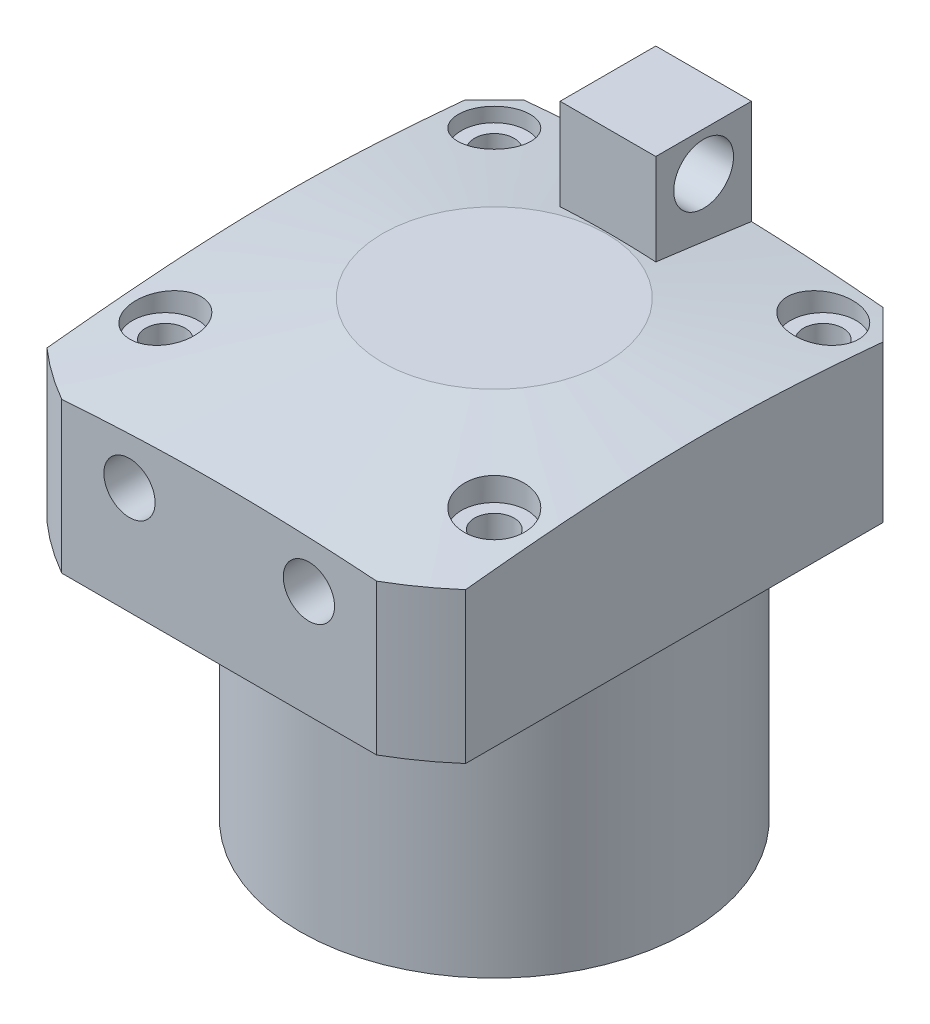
ISO-10303-21;
HEADER;
FILE_DESCRIPTION(('STEP AP214'),'2;1');
FILE_NAME('part.step','',(''),(''),'','','');
FILE_SCHEMA(('AUTOMOTIVE_DESIGN { 1 0 10303 214 1 1 1 1 }'));
ENDSEC;
DATA;
#1=APPLICATION_CONTEXT('core data for automotive mechanical design processes');
#2=APPLICATION_PROTOCOL_DEFINITION('international standard','automotive_design',2000,#1);
#3=PRODUCT_CONTEXT('',#1,'mechanical');
#4=PRODUCT('Part','Part','',(#3));
#5=PRODUCT_RELATED_PRODUCT_CATEGORY('part','',(#4));
#6=PRODUCT_DEFINITION_FORMATION('','',#4);
#7=PRODUCT_DEFINITION_CONTEXT('part definition',#1,'design');
#8=PRODUCT_DEFINITION('design','',#6,#7);
#9=PRODUCT_DEFINITION_SHAPE('','',#8);
#10=(LENGTH_UNIT() NAMED_UNIT(*) SI_UNIT(.MILLI.,.METRE.));
#11=(NAMED_UNIT(*) PLANE_ANGLE_UNIT() SI_UNIT($,.RADIAN.));
#12=(NAMED_UNIT(*) SI_UNIT($,.STERADIAN.) SOLID_ANGLE_UNIT());
#13=UNCERTAINTY_MEASURE_WITH_UNIT(LENGTH_MEASURE(1.E-05),#10,'distance_accuracy_value','');
#14=(GEOMETRIC_REPRESENTATION_CONTEXT(3) GLOBAL_UNCERTAINTY_ASSIGNED_CONTEXT((#13)) GLOBAL_UNIT_ASSIGNED_CONTEXT((#10,
#11,#12)) REPRESENTATION_CONTEXT('',''));
#15=CARTESIAN_POINT('',(0.,0.,0.));
#16=DIRECTION('',(0.,0.,1.));
#17=DIRECTION('',(1.,0.,0.));
#18=AXIS2_PLACEMENT_3D('',#15,#16,#17);
#19=CARTESIAN_POINT('',(8.,-0.001000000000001,-19.));
#20=DIRECTION('',(1.,0.,0.));
#21=DIRECTION('',(0.,0.,-1.));
#22=AXIS2_PLACEMENT_3D('',#19,#20,#21);
#23=PLANE('',#22);
#24=CARTESIAN_POINT('',(8.,84.,-27.));
#25=DIRECTION('',(1.,0.,0.));
#26=DIRECTION('',(0.,0.,-1.));
#27=AXIS2_PLACEMENT_3D('',#24,#25,#26);
#28=CIRCLE('',#27,5.);
#29=CARTESIAN_POINT('',(8.,84.,-32.));
#30=VERTEX_POINT('',#29);
#31=EDGE_CURVE('E115',#30,#30,#28,.T.);
#32=ORIENTED_EDGE('',*,*,#31,.F.);
#33=EDGE_LOOP('',(#32));
#34=FACE_BOUND('',#33,.T.);
#35=CARTESIAN_POINT('',(7.99999999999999,68.9279016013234,-64.9601883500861));
#36=CARTESIAN_POINT('',(7.99999999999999,69.2989363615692,-62.2998841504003));
#37=CARTESIAN_POINT('',(7.99999999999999,69.6697152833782,-59.6395440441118));
#38=CARTESIAN_POINT('',(7.99999999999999,70.4102504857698,-54.3188697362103));
#39=CARTESIAN_POINT('',(7.99999999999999,70.7800068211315,-51.6585355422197));
#40=CARTESIAN_POINT('',(7.99999999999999,71.3334941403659,-47.6680769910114));
#41=CARTESIAN_POINT('',(7.99999999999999,71.5177850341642,-46.3380303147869));
#42=CARTESIAN_POINT('',(7.99999999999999,71.8858778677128,-43.6778711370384));
#43=CARTESIAN_POINT('',(8.,72.0696798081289,-42.3477586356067));
#44=CARTESIAN_POINT('',(8.,72.4366573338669,-39.687377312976));
#45=CARTESIAN_POINT('',(8.,72.6198328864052,-38.3571084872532));
#46=CARTESIAN_POINT('',(8.,72.9853312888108,-35.6964469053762));
#47=CARTESIAN_POINT('',(8.,73.1676541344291,-34.3660541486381));
#48=CARTESIAN_POINT('',(8.,73.5311786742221,-31.7046907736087));
#49=CARTESIAN_POINT('',(8.,73.7123799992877,-30.3737201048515));
#50=CARTESIAN_POINT('',(8.,74.0730865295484,-27.7115732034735));
#51=CARTESIAN_POINT('',(8.,74.2525917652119,-26.3803969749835));
#52=CARTESIAN_POINT('',(8.,74.6090515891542,-23.7179191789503));
#53=CARTESIAN_POINT('',(8.,74.7860065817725,-22.3866176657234));
#54=CARTESIAN_POINT('',(8.,75.0484099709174,-20.3892222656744));
#55=CARTESIAN_POINT('',(8.,75.1353757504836,-19.7233278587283));
#56=CARTESIAN_POINT('',(8.,75.3079814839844,-18.3913671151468));
#57=CARTESIAN_POINT('',(8.,75.3936214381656,-17.7253007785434));
#58=CARTESIAN_POINT('',(8.,75.5632037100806,-16.3925695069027));
#59=CARTESIAN_POINT('',(8.,75.6471450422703,-15.7259044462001));
#60=CARTESIAN_POINT('',(8.,75.8126675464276,-14.3922865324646));
#61=CARTESIAN_POINT('',(8.,75.8942487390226,-13.7253336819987));
#62=CARTESIAN_POINT('',(8.,76.0541383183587,-12.3911539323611));
#63=CARTESIAN_POINT('',(8.,76.1324472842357,-11.7239271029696));
#64=CARTESIAN_POINT('',(8.,76.2844514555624,-10.3889501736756));
#65=CARTESIAN_POINT('',(8.,76.3581466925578,-9.7212000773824));
#66=CARTESIAN_POINT('',(8.,76.4989304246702,-8.38448050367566));
#67=CARTESIAN_POINT('',(8.,76.5660138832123,-7.71551048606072));
#68=CARTESIAN_POINT('',(8.,76.6592742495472,-6.71140341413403));
#69=CARTESIAN_POINT('',(8.,76.6891322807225,-6.37660886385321));
#70=CARTESIAN_POINT('',(8.,76.7458688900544,-5.70676370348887));
#71=CARTESIAN_POINT('',(8.,76.7727474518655,-5.37171309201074));
#72=CARTESIAN_POINT('',(8.,76.8229588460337,-4.70110775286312));
#73=CARTESIAN_POINT('',(8.,76.8462891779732,-4.3655528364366));
#74=CARTESIAN_POINT('',(8.,76.88873817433,-3.69418099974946));
#75=CARTESIAN_POINT('',(8.,76.9078569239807,-3.35836408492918));
#76=CARTESIAN_POINT('',(8.,76.9412296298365,-2.68636408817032));
#77=CARTESIAN_POINT('',(8.,76.955481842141,-2.3501809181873));
#78=CARTESIAN_POINT('',(8.,76.9785729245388,-1.67760515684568));
#79=CARTESIAN_POINT('',(8.,76.9874113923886,-1.34121255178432));
#80=CARTESIAN_POINT('',(8.,76.993272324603,-1.00475854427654));
#81=B_SPLINE_CURVE_WITH_KNOTS('',3,(#35,#36,#37,#38,#39,#40,#41,#42,#43,#44,#45,#46,#47,#48,#49,
#50,#51,#52,#53,#54,#55,#56,#57,#58,#59,#60,#61,#62,#63,#64,#65,#66,#67,#68,#69,#70,#71,#72,#73,
#74,#75,#76,#77,#78,#79,#80),.UNSPECIFIED.,.F.,.F.,(4,2,2,2,2,2,2,2,2,2,2,2,2,2,2,2,2,2,2,2,2,2,
4),(0.,8.0581618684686,16.1158833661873,20.1441441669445,24.172399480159,28.2008624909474,
32.2293455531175,36.2590905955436,40.288763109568,44.3177895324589,46.3324363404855,
48.3470827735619,50.3628664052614,52.3786324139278,54.3940401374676,56.4094340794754,
58.4263515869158,59.4347111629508,60.4430762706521,61.4521487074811,62.4612007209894,
63.4706139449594,64.4801021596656),.UNSPECIFIED.);
#82=CARTESIAN_POINT('',(7.99999999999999,73.0806440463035,-35.));
#83=VERTEX_POINT('',#82);
#84=CARTESIAN_POINT('',(8.00000000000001,75.2291083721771,-19.));
#85=VERTEX_POINT('',#84);
#86=EDGE_CURVE('E94',#83,#85,#81,.T.);
#87=ORIENTED_EDGE('',*,*,#86,.F.);
#88=DIRECTION('',(0.,1.,0.));
#89=VECTOR('',#88,1.);
#90=CARTESIAN_POINT('',(8.,-0.001000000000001,-35.));
#91=LINE('',#90,#89);
#92=CARTESIAN_POINT('',(8.,90.5,-35.));
#93=VERTEX_POINT('',#92);
#94=EDGE_CURVE('E89',#83,#93,#91,.T.);
#95=ORIENTED_EDGE('',*,*,#94,.T.);
#96=DIRECTION('',(0.,0.,-1.));
#97=VECTOR('',#96,1.);
#98=CARTESIAN_POINT('',(8.,90.5,-19.));
#99=LINE('',#98,#97);
#100=CARTESIAN_POINT('',(8.,90.5,-19.));
#101=VERTEX_POINT('',#100);
#102=EDGE_CURVE('E93',#101,#93,#99,.T.);
#103=ORIENTED_EDGE('',*,*,#102,.F.);
#104=DIRECTION('',(0.,1.,0.));
#105=VECTOR('',#104,1.);
#106=CARTESIAN_POINT('',(8.,-0.001000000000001,-19.));
#107=LINE('',#106,#105);
#108=EDGE_CURVE('E96',#85,#101,#107,.T.);
#109=ORIENTED_EDGE('',*,*,#108,.F.);
#110=EDGE_LOOP('',(#87,#95,#103,#109));
#111=FACE_BOUND('',#110,.T.);
#112=ADVANCED_FACE('F48',(#34,#111),#23,.T.);
#113=CARTESIAN_POINT('',(-8.,-0.001000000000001,-19.));
#114=DIRECTION('',(0.,0.,1.));
#115=DIRECTION('',(1.,0.,0.));
#116=AXIS2_PLACEMENT_3D('',#113,#114,#115);
#117=PLANE('',#116);
#118=CARTESIAN_POINT('',(-26.089737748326,73.5904790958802,-19.));
#119=CARTESIAN_POINT('',(-25.257890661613,73.6849543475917,-19.));
#120=CARTESIAN_POINT('',(-24.4258704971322,73.7779382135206,-19.));
#121=CARTESIAN_POINT('',(-22.7614047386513,73.9601469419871,-19.));
#122=CARTESIAN_POINT('',(-21.9289591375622,74.0493717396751,-19.));
#123=CARTESIAN_POINT('',(-20.2632651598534,74.2233169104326,-19.));
#124=CARTESIAN_POINT('',(-19.4300165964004,74.3080355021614,-19.));
#125=CARTESIAN_POINT('',(-17.7629738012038,74.4719157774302,-19.));
#126=CARTESIAN_POINT('',(-16.9291795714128,74.5510774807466,-19.));
#127=CARTESIAN_POINT('',(-15.26298796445,74.7024355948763,-19.));
#128=CARTESIAN_POINT('',(-14.4305920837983,74.7746483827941,-19.));
#129=CARTESIAN_POINT('',(-12.7651185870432,74.9108718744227,-19.));
#130=CARTESIAN_POINT('',(-11.9320409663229,74.9748825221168,-19.));
#131=CARTESIAN_POINT('',(-10.2652703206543,75.0930337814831,-19.));
#132=CARTESIAN_POINT('',(-9.43157737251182,75.1471754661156,-19.));
#133=CARTESIAN_POINT('',(-7.76352481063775,75.2438186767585,-19.));
#134=CARTESIAN_POINT('',(-6.92916520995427,75.2863204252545,-19.));
#135=CARTESIAN_POINT('',(-5.2576838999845,75.3580672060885,-19.));
#136=CARTESIAN_POINT('',(-4.42056066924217,75.3872773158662,-19.));
#137=CARTESIAN_POINT('',(-2.74592568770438,75.4308912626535,-19.));
#138=CARTESIAN_POINT('',(-1.90841393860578,75.4452951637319,-19.));
#139=CARTESIAN_POINT('',(-0.233292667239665,75.4585414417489,-19.));
#140=CARTESIAN_POINT('',(0.60431685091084,75.4573843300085,-19.));
#141=CARTESIAN_POINT('',(2.27937015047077,75.4395723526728,-19.));
#142=CARTESIAN_POINT('',(3.11681393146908,75.4229174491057,-19.));
#143=CARTESIAN_POINT('',(4.79211304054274,75.3749499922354,-19.));
#144=CARTESIAN_POINT('',(5.62996794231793,75.3436227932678,-19.));
#145=CARTESIAN_POINT('',(7.30508856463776,75.2677636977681,-19.));
#146=CARTESIAN_POINT('',(8.14235427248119,75.22323152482,-19.));
#147=CARTESIAN_POINT('',(9.81626895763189,75.1227156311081,-19.));
#148=CARTESIAN_POINT('',(10.6529178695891,75.0667308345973,-19.));
#149=CARTESIAN_POINT('',(12.3255010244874,74.945094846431,-19.));
#150=CARTESIAN_POINT('',(13.1614352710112,74.8794437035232,-19.));
#151=CARTESIAN_POINT('',(15.3378868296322,74.6980359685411,-19.));
#152=CARTESIAN_POINT('',(16.6778777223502,74.5759854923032,-19.));
#153=CARTESIAN_POINT('',(19.3564130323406,74.3169517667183,-19.));
#154=CARTESIAN_POINT('',(20.6949574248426,74.1799682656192,-19.));
#155=CARTESIAN_POINT('',(23.3709303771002,73.8951548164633,-19.));
#156=CARTESIAN_POINT('',(24.7083588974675,73.7473245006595,-19.));
#157=CARTESIAN_POINT('',(27.3822984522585,73.4437211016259,-19.));
#158=CARTESIAN_POINT('',(28.7188094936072,73.2879480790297,-19.));
#159=CARTESIAN_POINT('',(31.3875126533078,72.9709207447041,-19.));
#160=CARTESIAN_POINT('',(32.719706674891,72.809682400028,-19.));
#161=CARTESIAN_POINT('',(35.3835502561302,72.482749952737,-19.));
#162=CARTESIAN_POINT('',(36.7151998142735,72.3170558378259,-19.));
#163=CARTESIAN_POINT('',(39.3777694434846,71.9822832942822,-19.));
#164=CARTESIAN_POINT('',(40.7086896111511,71.8132056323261,-19.));
#165=CARTESIAN_POINT('',(43.3701728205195,71.4723344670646,-19.));
#166=CARTESIAN_POINT('',(44.7007358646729,71.3005409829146,-19.));
#167=CARTESIAN_POINT('',(46.0311666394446,71.12774061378,-19.));
#168=B_SPLINE_CURVE_WITH_KNOTS('',3,(#118,#119,#120,#121,#122,#123,#124,#125,#126,#127,#128,
#129,#130,#131,#132,#133,#134,#135,#136,#137,#138,#139,#140,#141,#142,#143,#144,#145,#146,#147,
#148,#149,#150,#151,#152,#153,#154,#155,#156,#157,#158,#159,#160,#161,#162,#163,#164,#165,#166,
#167),.UNSPECIFIED.,.F.,.F.,(4,2,2,2,2,2,2,2,2,2,2,2,2,2,2,2,2,2,2,2,2,2,2,2,4),(0.,
2.51158858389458,5.02322047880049,7.53583797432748,10.0484465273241,12.5549804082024,
15.0615314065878,17.5678097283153,20.0740401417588,22.5868179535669,25.0995848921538,
27.6122692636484,30.1249597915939,32.6401638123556,35.155420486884,37.670913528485,
40.1863938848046,44.2228775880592,48.2594293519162,52.2961180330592,56.3327759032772,
60.3585143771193,64.3842639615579,68.4091114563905,72.4339305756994),.UNSPECIFIED.);
#169=CARTESIAN_POINT('',(-8.,75.229108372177,-19.));
#170=VERTEX_POINT('',#169);
#171=EDGE_CURVE('E140',#85,#170,#168,.F.);
#172=ORIENTED_EDGE('',*,*,#171,.F.);
#173=ORIENTED_EDGE('',*,*,#108,.T.);
#174=DIRECTION('',(1.,0.,0.));
#175=VECTOR('',#174,1.);
#176=CARTESIAN_POINT('',(-8.,90.5,-19.));
#177=LINE('',#176,#175);
#178=CARTESIAN_POINT('',(-8.,90.5,-19.));
#179=VERTEX_POINT('',#178);
#180=EDGE_CURVE('E97',#179,#101,#177,.T.);
#181=ORIENTED_EDGE('',*,*,#180,.F.);
#182=DIRECTION('',(0.,1.,0.));
#183=VECTOR('',#182,1.);
#184=CARTESIAN_POINT('',(-8.,-0.001000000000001,-19.));
#185=LINE('',#184,#183);
#186=EDGE_CURVE('E149',#170,#179,#185,.T.);
#187=ORIENTED_EDGE('',*,*,#186,.F.);
#188=EDGE_LOOP('',(#172,#173,#181,#187));
#189=FACE_BOUND('',#188,.T.);
#190=ADVANCED_FACE('F134',(#189),#117,.T.);
#191=CARTESIAN_POINT('',(-8.,-0.001000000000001,-19.));
#192=DIRECTION('',(-1.,0.,0.));
#193=DIRECTION('',(0.,0.,1.));
#194=AXIS2_PLACEMENT_3D('',#191,#192,#193);
#195=PLANE('',#194);
#196=CARTESIAN_POINT('',(-8.,84.,-27.));
#197=DIRECTION('',(-1.,0.,0.));
#198=DIRECTION('',(0.,0.,1.));
#199=AXIS2_PLACEMENT_3D('',#196,#197,#198);
#200=CIRCLE('',#199,5.);
#201=CARTESIAN_POINT('',(-8.,84.,-22.));
#202=VERTEX_POINT('',#201);
#203=EDGE_CURVE('E112',#202,#202,#200,.F.);
#204=ORIENTED_EDGE('',*,*,#203,.T.);
#205=EDGE_LOOP('',(#204));
#206=FACE_BOUND('',#205,.T.);
#207=CARTESIAN_POINT('',(-8.,76.993272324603,-1.00475854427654));
#208=CARTESIAN_POINT('',(-8.,76.9873791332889,-1.34310472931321));
#209=CARTESIAN_POINT('',(-8.,76.978473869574,-1.68138860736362));
#210=CARTESIAN_POINT('',(-8.,76.9551911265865,-2.35774307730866));
#211=CARTESIAN_POINT('',(-8.,76.9408140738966,-2.69581368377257));
#212=CARTESIAN_POINT('',(-8.,76.9071454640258,-3.37156776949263));
#213=CARTESIAN_POINT('',(-8.,76.8878559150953,-3.70925135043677));
#214=CARTESIAN_POINT('',(-8.,76.8450263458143,-4.38435293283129));
#215=CARTESIAN_POINT('',(-8.,76.8214862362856,-4.72177092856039));
#216=CARTESIAN_POINT('',(-8.,76.7455219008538,-5.73322812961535));
#217=CARTESIAN_POINT('',(-8.,76.6877325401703,-6.40686339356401));
#218=CARTESIAN_POINT('',(-8.,76.5623293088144,-7.75321878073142));
#219=CARTESIAN_POINT('',(-8.,76.4947150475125,-8.42593886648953));
#220=CARTESIAN_POINT('',(-8.,76.3709897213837,-9.59811045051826));
#221=CARTESIAN_POINT('',(-8.,76.3163797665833,-10.0977219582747));
#222=CARTESIAN_POINT('',(-8.,76.2043361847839,-11.0966291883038));
#223=CARTESIAN_POINT('',(-8.,76.1469025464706,-11.5959249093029));
#224=CARTESIAN_POINT('',(-8.,76.0298775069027,-12.59425693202));
#225=CARTESIAN_POINT('',(-8.,75.9702861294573,-13.0932932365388));
#226=CARTESIAN_POINT('',(-8.,75.8494228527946,-14.0911625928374));
#227=CARTESIAN_POINT('',(-8.,75.7881509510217,-14.5899956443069));
#228=CARTESIAN_POINT('',(-8.,75.6023726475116,-16.0862611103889));
#229=CARTESIAN_POINT('',(-8.,75.4759048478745,-17.0834497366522));
#230=CARTESIAN_POINT('',(-8.,75.2196273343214,-19.0773974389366));
#231=CARTESIAN_POINT('',(-8.,75.0898176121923,-20.074156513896));
#232=CARTESIAN_POINT('',(-8.,74.8278140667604,-22.0682533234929));
#233=CARTESIAN_POINT('',(-8.,74.695618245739,-23.065590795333));
#234=CARTESIAN_POINT('',(-8.,74.4296252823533,-25.0600521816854));
#235=CARTESIAN_POINT('',(-8.,74.2958281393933,-26.057176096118));
#236=CARTESIAN_POINT('',(-8.,73.8927262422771,-29.0482738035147));
#237=CARTESIAN_POINT('',(-8.,73.6217053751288,-31.0420161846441));
#238=CARTESIAN_POINT('',(-8.,73.167517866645,-34.3670040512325));
#239=CARTESIAN_POINT('',(-8.,72.9850694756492,-35.6983479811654));
#240=CARTESIAN_POINT('',(-8.,72.6193102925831,-38.3609175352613));
#241=CARTESIAN_POINT('',(-8.,72.4359995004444,-39.692143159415));
#242=CARTESIAN_POINT('',(-8.,71.8851212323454,-43.6857109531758));
#243=CARTESIAN_POINT('',(-8.,71.5166107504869,-46.3479229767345));
#244=CARTESIAN_POINT('',(-8.,70.7786080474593,-51.6685644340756));
#245=CARTESIAN_POINT('',(-8.,70.4091178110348,-54.3269941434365));
#246=CARTESIAN_POINT('',(-8.,69.669140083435,-59.6436909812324));
#247=CARTESIAN_POINT('',(-8.,69.2986526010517,-62.3019581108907));
#248=CARTESIAN_POINT('',(-8.,68.9279016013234,-64.9601883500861));
#249=B_SPLINE_CURVE_WITH_KNOTS('',3,(#207,#208,#209,#210,#211,#212,#213,#214,#215,#216,#217,
#218,#219,#220,#221,#222,#223,#224,#225,#226,#227,#228,#229,#230,#231,#232,#233,#234,#235,#236,
#237,#238,#239,#240,#241,#242,#243,#244,#245,#246,#247,#248),.UNSPECIFIED.,.F.,.F.,(4,2,2,2,2,2,
2,2,2,2,2,2,2,2,2,2,2,2,2,2,4),(0.,1.01516485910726,2.03025059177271,3.04492201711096,
4.05961473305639,6.08782020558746,8.11610633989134,9.62385848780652,11.1316166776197,
12.6393582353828,14.1471020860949,17.1626203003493,20.1781459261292,23.1963255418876,
26.2145062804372,32.2507387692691,36.2821003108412,40.3134621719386,48.3762496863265,
56.4282023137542,64.480084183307),.UNSPECIFIED.);
#250=CARTESIAN_POINT('',(-8.,73.0806440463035,-35.));
#251=VERTEX_POINT('',#250);
#252=EDGE_CURVE('E53',#170,#251,#249,.T.);
#253=ORIENTED_EDGE('',*,*,#252,.F.);
#254=ORIENTED_EDGE('',*,*,#186,.T.);
#255=DIRECTION('',(0.,0.,1.));
#256=VECTOR('',#255,1.);
#257=CARTESIAN_POINT('',(-8.,90.5,-19.));
#258=LINE('',#257,#256);
#259=CARTESIAN_POINT('',(-8.,90.5,-35.));
#260=VERTEX_POINT('',#259);
#261=EDGE_CURVE('E107',#260,#179,#258,.T.);
#262=ORIENTED_EDGE('',*,*,#261,.F.);
#263=DIRECTION('',(0.,1.,0.));
#264=VECTOR('',#263,1.);
#265=CARTESIAN_POINT('',(-8.,-0.001000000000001,-35.));
#266=LINE('',#265,#264);
#267=EDGE_CURVE('E103',#251,#260,#266,.T.);
#268=ORIENTED_EDGE('',*,*,#267,.F.);
#269=EDGE_LOOP('',(#253,#254,#262,#268));
#270=FACE_BOUND('',#269,.T.);
#271=ADVANCED_FACE('F129',(#206,#270),#195,.T.);
#272=CARTESIAN_POINT('',(-8.,-0.001000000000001,-35.));
#273=DIRECTION('',(0.,0.,-1.));
#274=DIRECTION('',(-1.,0.,0.));
#275=AXIS2_PLACEMENT_3D('',#272,#273,#274);
#276=PLANE('',#275);
#277=CARTESIAN_POINT('',(-38.1851128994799,70.8466027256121,-35.));
#278=CARTESIAN_POINT('',(-36.8459693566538,70.985301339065,-35.));
#279=CARTESIAN_POINT('',(-35.5064855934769,71.1207857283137,-35.));
#280=CARTESIAN_POINT('',(-32.8267147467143,71.3838895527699,-35.));
#281=CARTESIAN_POINT('',(-31.4864276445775,71.5115087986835,-35.));
#282=CARTESIAN_POINT('',(-28.8043677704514,71.7574962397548,-35.));
#283=CARTESIAN_POINT('',(-27.4625945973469,71.8758601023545,-35.));
#284=CARTESIAN_POINT('',(-24.7781327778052,72.1015090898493,-35.));
#285=CARTESIAN_POINT('',(-23.4354441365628,72.2087942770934,-35.));
#286=CARTESIAN_POINT('',(-19.4138301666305,72.5104829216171,-35.));
#287=CARTESIAN_POINT('',(-16.7333657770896,72.6854750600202,-35.));
#288=CARTESIAN_POINT('',(-12.7102394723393,72.8961156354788,-35.));
#289=CARTESIAN_POINT('',(-11.3689180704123,72.9576845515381,-35.));
#290=CARTESIAN_POINT('',(-8.68551846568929,73.0615476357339,-35.));
#291=CARTESIAN_POINT('',(-7.34344026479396,73.1038418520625,-35.));
#292=CARTESIAN_POINT('',(-4.65749871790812,73.1676316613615,-35.));
#293=CARTESIAN_POINT('',(-3.31363489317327,73.1891072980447,-35.));
#294=CARTESIAN_POINT('',(-0.625732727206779,73.210331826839,-35.));
#295=CARTESIAN_POINT('',(0.718305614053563,73.2100807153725,-35.));
#296=CARTESIAN_POINT('',(3.40643617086,73.1878602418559,-35.));
#297=CARTESIAN_POINT('',(4.75052835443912,73.165887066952,-35.));
#298=CARTESIAN_POINT('',(7.43820159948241,73.1010928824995,-35.));
#299=CARTESIAN_POINT('',(8.78178266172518,73.0582719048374,-35.));
#300=CARTESIAN_POINT('',(11.4719860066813,72.9532094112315,-35.));
#301=CARTESIAN_POINT('',(12.8186061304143,72.8909132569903,-35.));
#302=CARTESIAN_POINT('',(15.5109619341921,72.7489636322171,-35.));
#303=CARTESIAN_POINT('',(16.8566975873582,72.6693096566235,-35.));
#304=CARTESIAN_POINT('',(19.5467714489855,72.4948800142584,-35.));
#305=CARTESIAN_POINT('',(20.8911099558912,72.4001088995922,-35.));
#306=CARTESIAN_POINT('',(23.5787222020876,72.1975500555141,-35.));
#307=CARTESIAN_POINT('',(24.9219960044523,72.0897631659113,-35.));
#308=CARTESIAN_POINT('',(26.264788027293,71.9765231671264,-35.));
#309=B_SPLINE_CURVE_WITH_KNOTS('',3,(#277,#278,#279,#280,#281,#282,#283,#284,#285,#286,#287,
#288,#289,#290,#291,#292,#293,#294,#295,#296,#297,#298,#299,#300,#301,#302,#303,#304,#305,#306,
#307,#308),.UNSPECIFIED.,.F.,.F.,(4,2,2,2,2,2,2,2,2,2,2,2,2,2,2,4),(0.,4.03892740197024,
8.07795197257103,12.1188560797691,16.1597374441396,24.2174230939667,28.2455119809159,
32.2735907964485,36.3055270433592,40.3374639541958,44.3701087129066,48.4027473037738,
52.4468027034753,56.4909757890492,60.5339333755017,64.5766302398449),.UNSPECIFIED.);
#310=EDGE_CURVE('E13',#251,#83,#309,.T.);
#311=ORIENTED_EDGE('',*,*,#310,.F.);
#312=ORIENTED_EDGE('',*,*,#267,.T.);
#313=DIRECTION('',(-1.,0.,0.));
#314=VECTOR('',#313,1.);
#315=CARTESIAN_POINT('',(-8.,90.5,-35.));
#316=LINE('',#315,#314);
#317=EDGE_CURVE('E100',#93,#260,#316,.T.);
#318=ORIENTED_EDGE('',*,*,#317,.F.);
#319=ORIENTED_EDGE('',*,*,#94,.F.);
#320=EDGE_LOOP('',(#311,#312,#318,#319));
#321=FACE_BOUND('',#320,.T.);
#322=ADVANCED_FACE('F101',(#321),#276,.T.);
#323=CARTESIAN_POINT('',(0.,75.5,0.));
#324=DIRECTION('',(0.,-1.,0.));
#325=DIRECTION('',(0.,0.,-1.));
#326=AXIS2_PLACEMENT_3D('',#323,#324,#325);
#327=CONICAL_SURFACE('',#326,18.6880340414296,1.43116998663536);
#328=ORIENTED_EDGE('',*,*,#86,.T.);
#329=ORIENTED_EDGE('',*,*,#171,.T.);
#330=ORIENTED_EDGE('',*,*,#252,.T.);
#331=ORIENTED_EDGE('',*,*,#310,.T.);
#332=EDGE_LOOP('',(#328,#329,#330,#331));
#333=FACE_BOUND('',#332,.T.);
#334=ADVANCED_FACE('F50',(#333),#327,.F.);
#335=CARTESIAN_POINT('',(8.,90.5,-35.));
#336=DIRECTION('',(0.,-1.,0.));
#337=DIRECTION('',(0.,0.,-1.));
#338=AXIS2_PLACEMENT_3D('',#335,#336,#337);
#339=PLANE('',#338);
#340=ORIENTED_EDGE('',*,*,#102,.T.);
#341=ORIENTED_EDGE('',*,*,#317,.T.);
#342=ORIENTED_EDGE('',*,*,#261,.T.);
#343=ORIENTED_EDGE('',*,*,#180,.T.);
#344=EDGE_LOOP('',(#340,#341,#342,#343));
#345=FACE_BOUND('',#344,.T.);
#346=ADVANCED_FACE('F110',(#345),#339,.F.);
#347=CARTESIAN_POINT('',(-22.142135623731,84.,-27.));
#348=DIRECTION('',(1.,0.,0.));
#349=DIRECTION('',(0.,0.,-1.));
#350=AXIS2_PLACEMENT_3D('',#347,#348,#349);
#351=CYLINDRICAL_SURFACE('',#350,5.);
#352=ORIENTED_EDGE('',*,*,#31,.T.);
#353=EDGE_LOOP('',(#352));
#354=FACE_BOUND('',#353,.T.);
#355=ORIENTED_EDGE('',*,*,#203,.F.);
#356=EDGE_LOOP('',(#355));
#357=FACE_BOUND('',#356,.T.);
#358=ADVANCED_FACE('F158',(#354,#357),#351,.F.);
#359=CLOSED_SHELL('',(#112,#190,#271,#322,#334,#346,#358));
#360=MANIFOLD_SOLID_BREP('B2',#359);
#361=CARTESIAN_POINT('',(-32.5,45.5,0.));
#362=DIRECTION('',(0.,-1.,0.));
#363=DIRECTION('',(0.,0.,-1.));
#364=AXIS2_PLACEMENT_3D('',#361,#362,#363);
#365=PLANE('',#364);
#366=CARTESIAN_POINT('',(-15.,45.5,39.5));
#367=DIRECTION('',(0.,-1.,0.));
#368=DIRECTION('',(0.,0.,-1.));
#369=AXIS2_PLACEMENT_3D('',#366,#367,#368);
#370=CIRCLE('',#369,3.99999999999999);
#371=CARTESIAN_POINT('',(-15.,45.5,35.5));
#372=VERTEX_POINT('',#371);
#373=EDGE_CURVE('E593',#372,#372,#370,.T.);
#374=ORIENTED_EDGE('',*,*,#373,.F.);
#375=EDGE_LOOP('',(#374));
#376=FACE_BOUND('',#375,.T.);
#377=CARTESIAN_POINT('',(15.,45.5,39.5));
#378=DIRECTION('',(0.,-1.,0.));
#379=DIRECTION('',(0.,0.,-1.));
#380=AXIS2_PLACEMENT_3D('',#377,#378,#379);
#381=CIRCLE('',#380,3.99999999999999);
#382=CARTESIAN_POINT('',(15.,45.5,35.5));
#383=VERTEX_POINT('',#382);
#384=EDGE_CURVE('E587',#383,#383,#381,.T.);
#385=ORIENTED_EDGE('',*,*,#384,.F.);
#386=EDGE_LOOP('',(#385));
#387=FACE_BOUND('',#386,.T.);
#388=CARTESIAN_POINT('',(-27.5,45.5,-27.5));
#389=DIRECTION('',(0.,1.,0.));
#390=DIRECTION('',(0.,0.,1.));
#391=AXIS2_PLACEMENT_3D('',#388,#389,#390);
#392=CIRCLE('',#391,3.32499999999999);
#393=CARTESIAN_POINT('',(-27.5,45.5,-24.175));
#394=VERTEX_POINT('',#393);
#395=EDGE_CURVE('E581',#394,#394,#392,.T.);
#396=ORIENTED_EDGE('',*,*,#395,.T.);
#397=EDGE_LOOP('',(#396));
#398=FACE_BOUND('',#397,.T.);
#399=CARTESIAN_POINT('',(27.5,45.5,-27.5));
#400=DIRECTION('',(0.,1.,0.));
#401=DIRECTION('',(0.,0.,1.));
#402=AXIS2_PLACEMENT_3D('',#399,#400,#401);
#403=CIRCLE('',#402,3.32499999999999);
#404=CARTESIAN_POINT('',(27.5,45.5,-24.175));
#405=VERTEX_POINT('',#404);
#406=EDGE_CURVE('E569',#405,#405,#403,.T.);
#407=ORIENTED_EDGE('',*,*,#406,.T.);
#408=EDGE_LOOP('',(#407));
#409=FACE_BOUND('',#408,.T.);
#410=CARTESIAN_POINT('',(27.5,45.5,27.5));
#411=DIRECTION('',(0.,1.,0.));
#412=DIRECTION('',(0.,0.,1.));
#413=AXIS2_PLACEMENT_3D('',#410,#411,#412);
#414=CIRCLE('',#413,3.32499999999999);
#415=CARTESIAN_POINT('',(27.5,45.5,30.825));
#416=VERTEX_POINT('',#415);
#417=EDGE_CURVE('E393',#416,#416,#414,.T.);
#418=ORIENTED_EDGE('',*,*,#417,.T.);
#419=EDGE_LOOP('',(#418));
#420=FACE_BOUND('',#419,.T.);
#421=CARTESIAN_POINT('',(-27.5,45.5,27.5));
#422=DIRECTION('',(0.,1.,0.));
#423=DIRECTION('',(0.,0.,1.));
#424=AXIS2_PLACEMENT_3D('',#421,#422,#423);
#425=CIRCLE('',#424,3.32499999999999);
#426=CARTESIAN_POINT('',(-27.5,45.5,30.825));
#427=VERTEX_POINT('',#426);
#428=EDGE_CURVE('E547',#427,#427,#425,.T.);
#429=ORIENTED_EDGE('',*,*,#428,.T.);
#430=EDGE_LOOP('',(#429));
#431=FACE_BOUND('',#430,.T.);
#432=CARTESIAN_POINT('',(0.,45.5,0.));
#433=DIRECTION('',(0.,1.,0.));
#434=DIRECTION('',(0.,0.,1.));
#435=AXIS2_PLACEMENT_3D('',#432,#433,#434);
#436=CIRCLE('',#435,32.5);
#437=CARTESIAN_POINT('',(0.,45.5,32.5));
#438=VERTEX_POINT('',#437);
#439=EDGE_CURVE('E322',#438,#438,#436,.T.);
#440=ORIENTED_EDGE('',*,*,#439,.T.);
#441=EDGE_LOOP('',(#440));
#442=FACE_BOUND('',#441,.T.);
#443=DIRECTION('',(1.,0.,0.));
#444=VECTOR('',#443,1.);
#445=CARTESIAN_POINT('',(-32.5,45.5,-35.));
#446=LINE('',#445,#444);
#447=CARTESIAN_POINT('',(-30.,45.5,-35.));
#448=VERTEX_POINT('',#447);
#449=CARTESIAN_POINT('',(30.,45.5,-35.));
#450=VERTEX_POINT('',#449);
#451=EDGE_CURVE('E304',#448,#450,#446,.T.);
#452=ORIENTED_EDGE('',*,*,#451,.T.);
#453=DIRECTION('',(-0.707106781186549,0.,-0.707106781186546));
#454=VECTOR('',#453,1.);
#455=CARTESIAN_POINT('',(16.2499999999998,45.5,-48.7500000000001));
#456=LINE('',#455,#454);
#457=CARTESIAN_POINT('',(35.,45.5,-30.));
#458=VERTEX_POINT('',#457);
#459=EDGE_CURVE('E227',#450,#458,#456,.F.);
#460=ORIENTED_EDGE('',*,*,#459,.T.);
#461=DIRECTION('',(0.,0.,1.));
#462=VECTOR('',#461,1.);
#463=CARTESIAN_POINT('',(35.,45.5,0.));
#464=LINE('',#463,#462);
#465=CARTESIAN_POINT('',(35.,45.5,39.7994974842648));
#466=VERTEX_POINT('',#465);
#467=EDGE_CURVE('E315',#458,#466,#464,.T.);
#468=ORIENTED_EDGE('',*,*,#467,.T.);
#469=CARTESIAN_POINT('',(0.,45.5,0.));
#470=DIRECTION('',(0.,1.,0.));
#471=DIRECTION('',(0.,0.,1.));
#472=AXIS2_PLACEMENT_3D('',#469,#470,#471);
#473=CIRCLE('',#472,53.);
#474=CARTESIAN_POINT('',(26.3248931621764,45.5,46.));
#475=VERTEX_POINT('',#474);
#476=EDGE_CURVE('E319',#475,#466,#473,.T.);
#477=ORIENTED_EDGE('',*,*,#476,.F.);
#478=DIRECTION('',(-1.,0.,0.));
#479=VECTOR('',#478,1.);
#480=CARTESIAN_POINT('',(-32.5,45.5,46.));
#481=LINE('',#480,#479);
#482=CARTESIAN_POINT('',(-26.3248931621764,45.5,46.));
#483=VERTEX_POINT('',#482);
#484=EDGE_CURVE('E516',#475,#483,#481,.T.);
#485=ORIENTED_EDGE('',*,*,#484,.T.);
#486=CARTESIAN_POINT('',(-35.,45.5,39.7994974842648));
#487=VERTEX_POINT('',#486);
#488=EDGE_CURVE('E313',#487,#483,#473,.T.);
#489=ORIENTED_EDGE('',*,*,#488,.F.);
#490=DIRECTION('',(0.,0.,-1.));
#491=VECTOR('',#490,1.);
#492=CARTESIAN_POINT('',(-35.,45.5,0.));
#493=LINE('',#492,#491);
#494=CARTESIAN_POINT('',(-35.,45.5,-30.));
#495=VERTEX_POINT('',#494);
#496=EDGE_CURVE('E300',#487,#495,#493,.T.);
#497=ORIENTED_EDGE('',*,*,#496,.T.);
#498=DIRECTION('',(-0.707106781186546,0.,0.707106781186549));
#499=VECTOR('',#498,1.);
#500=CARTESIAN_POINT('',(-48.75,45.5,-16.2499999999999));
#501=LINE('',#500,#499);
#502=EDGE_CURVE('E503',#495,#448,#501,.F.);
#503=ORIENTED_EDGE('',*,*,#502,.T.);
#504=EDGE_LOOP('',(#452,#460,#468,#477,#485,#489,#497,#503));
#505=FACE_BOUND('',#504,.T.);
#506=ADVANCED_FACE('F213',(#376,#387,#398,#409,#420,#431,#442,#505),#365,.T.);
#507=CARTESIAN_POINT('',(0.,87.0508296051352,0.));
#508=DIRECTION('',(0.,1.,0.));
#509=DIRECTION('',(0.,0.,1.));
#510=AXIS2_PLACEMENT_3D('',#507,#508,#509);
#511=CYLINDRICAL_SURFACE('',#510,53.);
#512=ORIENTED_EDGE('',*,*,#476,.T.);
#513=DIRECTION('',(0.,1.,0.));
#514=VECTOR('',#513,1.);
#515=CARTESIAN_POINT('',(35.,87.0508296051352,39.7994974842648));
#516=LINE('',#515,#514);
#517=CARTESIAN_POINT('',(35.,70.6777676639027,39.7994974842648));
#518=VERTEX_POINT('',#517);
#519=EDGE_CURVE('E513',#466,#518,#516,.T.);
#520=ORIENTED_EDGE('',*,*,#519,.T.);
#521=CARTESIAN_POINT('',(0.,70.6777676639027,0.));
#522=DIRECTION('',(0.,1.,0.));
#523=DIRECTION('',(0.,0.,1.));
#524=AXIS2_PLACEMENT_3D('',#521,#522,#523);
#525=CIRCLE('',#524,53.);
#526=CARTESIAN_POINT('',(26.3248931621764,70.6777676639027,46.));
#527=VERTEX_POINT('',#526);
#528=EDGE_CURVE('E309',#527,#518,#525,.T.);
#529=ORIENTED_EDGE('',*,*,#528,.F.);
#530=DIRECTION('',(0.,1.,0.));
#531=VECTOR('',#530,1.);
#532=CARTESIAN_POINT('',(26.3248931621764,87.0508296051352,46.));
#533=LINE('',#532,#531);
#534=EDGE_CURVE('E519',#527,#475,#533,.F.);
#535=ORIENTED_EDGE('',*,*,#534,.T.);
#536=EDGE_LOOP('',(#512,#520,#529,#535));
#537=FACE_BOUND('',#536,.T.);
#538=ADVANCED_FACE('F347',(#537),#511,.T.);
#539=ORIENTED_EDGE('',*,*,#488,.T.);
#540=DIRECTION('',(0.,1.,0.));
#541=VECTOR('',#540,1.);
#542=CARTESIAN_POINT('',(-26.3248931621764,87.0508296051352,46.));
#543=LINE('',#542,#541);
#544=CARTESIAN_POINT('',(-26.3248931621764,70.6777676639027,46.));
#545=VERTEX_POINT('',#544);
#546=EDGE_CURVE('E308',#483,#545,#543,.T.);
#547=ORIENTED_EDGE('',*,*,#546,.T.);
#548=CARTESIAN_POINT('',(-35.,70.6777676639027,39.7994974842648));
#549=VERTEX_POINT('',#548);
#550=EDGE_CURVE('E291',#549,#545,#525,.T.);
#551=ORIENTED_EDGE('',*,*,#550,.F.);
#552=DIRECTION('',(0.,1.,0.));
#553=VECTOR('',#552,1.);
#554=CARTESIAN_POINT('',(-35.,87.0508296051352,39.7994974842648));
#555=LINE('',#554,#553);
#556=EDGE_CURVE('E298',#549,#487,#555,.F.);
#557=ORIENTED_EDGE('',*,*,#556,.T.);
#558=EDGE_LOOP('',(#539,#547,#551,#557));
#559=FACE_BOUND('',#558,.T.);
#560=ADVANCED_FACE('F307',(#559),#511,.T.);
#561=CARTESIAN_POINT('',(0.,75.5,0.));
#562=DIRECTION('',(0.,-1.,0.));
#563=DIRECTION('',(0.,0.,-1.));
#564=AXIS2_PLACEMENT_3D('',#561,#562,#563);
#565=CONICAL_SURFACE('',#564,18.6880340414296,1.43116998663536);
#566=CARTESIAN_POINT('',(-31.3890887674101,71.8877033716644,-31.3890887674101));
#567=CARTESIAN_POINT('',(-31.4977285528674,71.8877031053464,-31.2804503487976));
#568=CARTESIAN_POINT('',(-31.6017988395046,71.8884948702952,-31.1672682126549));
#569=CARTESIAN_POINT('',(-31.800125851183,71.8916619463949,-30.9325671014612));
#570=CARTESIAN_POINT('',(-31.8943799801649,71.8940376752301,-30.8110459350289));
#571=CARTESIAN_POINT('',(-32.0724443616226,71.900361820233,-30.5604579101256));
#572=CARTESIAN_POINT('',(-32.156245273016,71.9043116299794,-30.4313844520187));
#573=CARTESIAN_POINT('',(-32.3127482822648,71.913765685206,-30.1666653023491));
#574=CARTESIAN_POINT('',(-32.3854462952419,71.9192705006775,-30.0310172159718));
#575=CARTESIAN_POINT('',(-32.5191335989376,71.9317990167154,-29.7543037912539));
#576=CARTESIAN_POINT('',(-32.5801344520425,71.938821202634,-29.6132439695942));
#577=CARTESIAN_POINT('',(-32.6901206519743,71.9543540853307,-29.3265352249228));
#578=CARTESIAN_POINT('',(-32.7391015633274,71.962865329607,-29.1808846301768));
#579=CARTESIAN_POINT('',(-32.824664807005,71.981324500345,-28.8861726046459));
#580=CARTESIAN_POINT('',(-32.8612547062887,71.9912715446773,-28.7371133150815));
#581=CARTESIAN_POINT('',(-32.9218527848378,72.0125581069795,-28.4364995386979));
#582=CARTESIAN_POINT('',(-32.9458562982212,72.0238981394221,-28.2849441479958));
#583=CARTESIAN_POINT('',(-32.9811666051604,72.0479418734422,-27.9800343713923));
#584=CARTESIAN_POINT('',(-32.9924375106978,72.060649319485,-27.8266761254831));
#585=CARTESIAN_POINT('',(-33.0021105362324,72.0873387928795,-27.5196087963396));
#586=CARTESIAN_POINT('',(-33.0005079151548,72.101321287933,-27.3658996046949));
#587=CARTESIAN_POINT('',(-32.9844645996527,72.1304772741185,-27.0593144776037));
#588=CARTESIAN_POINT('',(-32.9700278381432,72.1456503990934,-26.9064383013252));
#589=CARTESIAN_POINT('',(-32.9284439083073,72.1771148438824,-26.6024837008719));
#590=CARTESIAN_POINT('',(-32.9012920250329,72.1934065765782,-26.4514059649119));
#591=CARTESIAN_POINT('',(-32.8342665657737,72.2271278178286,-26.1511406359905));
#592=CARTESIAN_POINT('',(-32.7943080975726,72.2445642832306,-26.0019727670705));
#593=CARTESIAN_POINT('',(-32.7020204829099,72.2803826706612,-25.7075734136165));
#594=CARTESIAN_POINT('',(-32.6496867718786,72.2987649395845,-25.5623434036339));
#595=CARTESIAN_POINT('',(-32.5330592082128,72.336359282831,-25.2769253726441));
#596=CARTESIAN_POINT('',(-32.4687693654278,72.3555710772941,-25.1367356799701));
#597=CARTESIAN_POINT('',(-32.3287004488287,72.3947176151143,-24.8623058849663));
#598=CARTESIAN_POINT('',(-32.2529171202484,72.4146526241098,-24.7280680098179));
#599=CARTESIAN_POINT('',(-32.0078556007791,72.4756751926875,-24.333726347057));
#600=CARTESIAN_POINT('',(-31.8216807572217,72.5177184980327,-24.0839858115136));
#601=CARTESIAN_POINT('',(-31.4101791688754,72.6031863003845,-23.6196807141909));
#602=CARTESIAN_POINT('',(-31.1848509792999,72.6466108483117,-23.4051174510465));
#603=CARTESIAN_POINT('',(-30.6998904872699,72.733964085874,-23.0158186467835));
#604=CARTESIAN_POINT('',(-30.44006616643,72.7778942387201,-22.8413221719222));
#605=CARTESIAN_POINT('',(-29.8944982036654,72.8647290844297,-22.5387805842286));
#606=CARTESIAN_POINT('',(-29.6087540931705,72.9076337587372,-22.4107363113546));
#607=CARTESIAN_POINT('',(-29.0191693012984,72.991104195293,-22.2047477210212));
#608=CARTESIAN_POINT('',(-28.7153154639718,73.031668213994,-22.1268403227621));
#609=CARTESIAN_POINT('',(-28.0983208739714,73.1090313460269,-22.0237023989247));
#610=CARTESIAN_POINT('',(-27.7851803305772,73.1458305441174,-21.998470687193));
#611=CARTESIAN_POINT('',(-27.1604825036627,73.2140788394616,-22.0016633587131));
#612=CARTESIAN_POINT('',(-26.8489270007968,73.2455587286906,-22.0297665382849));
#613=CARTESIAN_POINT('',(-26.2345160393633,73.3021628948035,-22.1384833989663));
#614=CARTESIAN_POINT('',(-25.9316600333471,73.3272875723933,-22.219093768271));
#615=CARTESIAN_POINT('',(-25.3468469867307,73.3698463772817,-22.4295535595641));
#616=CARTESIAN_POINT('',(-25.0646937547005,73.3873635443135,-22.5588409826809));
#617=CARTESIAN_POINT('',(-24.5258346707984,73.414318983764,-22.8631833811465));
#618=CARTESIAN_POINT('',(-24.2691270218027,73.4237578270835,-23.0382351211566));
#619=CARTESIAN_POINT('',(-23.7912896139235,73.4340570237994,-23.4270010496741));
#620=CARTESIAN_POINT('',(-23.569806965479,73.4350085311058,-23.6402792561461));
#621=CARTESIAN_POINT('',(-23.1654688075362,73.4285274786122,-24.1006344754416));
#622=CARTESIAN_POINT('',(-22.9826121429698,73.4210951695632,-24.3477104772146));
#623=CARTESIAN_POINT('',(-22.6612139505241,73.3982317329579,-24.8676537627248));
#624=CARTESIAN_POINT('',(-22.5225230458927,73.3828280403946,-25.1404299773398));
#625=CARTESIAN_POINT('',(-22.2923261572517,73.3447248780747,-25.7047290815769));
#626=CARTESIAN_POINT('',(-22.2008213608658,73.3220252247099,-25.9962524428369));
#627=CARTESIAN_POINT('',(-22.0668860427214,73.2701263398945,-26.5917153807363));
#628=CARTESIAN_POINT('',(-22.0247644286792,73.240887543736,-26.8957209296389));
#629=CARTESIAN_POINT('',(-21.9915198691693,73.177154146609,-27.5059569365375));
#630=CARTESIAN_POINT('',(-22.0003999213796,73.1426592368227,-27.8121875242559));
#631=CARTESIAN_POINT('',(-22.0690542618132,73.069253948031,-28.4219845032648));
#632=CARTESIAN_POINT('',(-22.1294156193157,73.0302971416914,-28.7254791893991));
#633=CARTESIAN_POINT('',(-22.2999341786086,72.9496318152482,-29.317768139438));
#634=CARTESIAN_POINT('',(-22.4100941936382,72.9079231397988,-29.6065615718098));
#635=CARTESIAN_POINT('',(-22.6783464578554,72.8226436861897,-30.1642876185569));
#636=CARTESIAN_POINT('',(-22.8369116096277,72.7790583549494,-30.4329901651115));
#637=CARTESIAN_POINT('',(-23.1972308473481,72.691684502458,-30.939874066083));
#638=CARTESIAN_POINT('',(-23.3989863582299,72.6478959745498,-31.1780544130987));
#639=CARTESIAN_POINT('',(-23.7298893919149,72.5829280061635,-31.5075884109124));
#640=CARTESIAN_POINT('',(-23.8452426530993,72.5613353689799,-31.613050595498));
#641=CARTESIAN_POINT('',(-24.0845316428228,72.5185503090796,-31.8138057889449));
#642=CARTESIAN_POINT('',(-24.2084641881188,72.497357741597,-31.9091025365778));
#643=CARTESIAN_POINT('',(-24.4640914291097,72.4555005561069,-32.0888665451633));
#644=CARTESIAN_POINT('',(-24.5957890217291,72.4348361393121,-32.1733297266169));
#645=CARTESIAN_POINT('',(-24.8659280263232,72.3941782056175,-32.3307442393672));
#646=CARTESIAN_POINT('',(-25.0043668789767,72.3741844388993,-32.4036998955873));
#647=CARTESIAN_POINT('',(-25.2867810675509,72.3350191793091,-32.537462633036));
#648=CARTESIAN_POINT('',(-25.4307454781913,72.31584620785,-32.5982923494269));
#649=CARTESIAN_POINT('',(-25.7233760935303,72.2784037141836,-32.7074933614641));
#650=CARTESIAN_POINT('',(-25.8720405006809,72.2601338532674,-32.7558693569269));
#651=CARTESIAN_POINT('',(-26.1731069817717,72.2245910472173,-32.8398300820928));
#652=CARTESIAN_POINT('',(-26.3255102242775,72.2073184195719,-32.8754107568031));
#653=CARTESIAN_POINT('',(-26.6328532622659,72.1738821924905,-32.9334615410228));
#654=CARTESIAN_POINT('',(-26.7877920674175,72.1577181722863,-32.9559366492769));
#655=CARTESIAN_POINT('',(-27.0981361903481,72.1266842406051,-32.9875018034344));
#656=CARTESIAN_POINT('',(-27.2535320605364,72.111806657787,-32.9966772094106));
#657=CARTESIAN_POINT('',(-27.5645991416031,72.0833177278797,-33.0018192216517));
#658=CARTESIAN_POINT('',(-27.7202702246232,72.0697058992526,-32.9977908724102));
#659=CARTESIAN_POINT('',(-28.0309136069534,72.0438091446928,-32.9765301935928));
#660=CARTESIAN_POINT('',(-28.185885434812,72.0315250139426,-32.9592900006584));
#661=CARTESIAN_POINT('',(-28.493850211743,72.0083643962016,-32.9117029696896));
#662=CARTESIAN_POINT('',(-28.6468438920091,71.9974873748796,-32.8813611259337));
#663=CARTESIAN_POINT('',(-28.948700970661,71.9772676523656,-32.8080330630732));
#664=CARTESIAN_POINT('',(-29.0975861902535,71.9679144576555,-32.7651395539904));
#665=CARTESIAN_POINT('',(-29.391229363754,71.9507011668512,-32.6669343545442));
#666=CARTESIAN_POINT('',(-29.5359888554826,71.942840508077,-32.6116273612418));
#667=CARTESIAN_POINT('',(-29.8202584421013,71.9286560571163,-32.4890216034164));
#668=CARTESIAN_POINT('',(-29.9597732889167,71.9223308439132,-32.4217340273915));
#669=CARTESIAN_POINT('',(-30.2326359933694,71.9112429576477,-32.2756308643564));
#670=CARTESIAN_POINT('',(-30.365985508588,71.9064798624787,-32.1968183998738));
#671=CARTESIAN_POINT('',(-30.6567116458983,71.8975868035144,-32.0079894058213));
#672=CARTESIAN_POINT('',(-30.8121948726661,71.8938816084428,-31.8950200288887));
#673=CARTESIAN_POINT('',(-31.1105253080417,71.8889400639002,-31.6534269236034));
#674=CARTESIAN_POINT('',(-31.2533725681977,71.8877037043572,-31.5248032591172));
#675=CARTESIAN_POINT('',(-31.3890887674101,71.8877033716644,-31.3890887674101));
#676=B_SPLINE_CURVE_WITH_KNOTS('',3,(#566,#567,#568,#569,#570,#571,#572,#573,#574,#575,#576,
#577,#578,#579,#580,#581,#582,#583,#584,#585,#586,#587,#588,#589,#590,#591,#592,#593,#594,#595,
#596,#597,#598,#599,#600,#601,#602,#603,#604,#605,#606,#607,#608,#609,#610,#611,#612,#613,#614,
#615,#616,#617,#618,#619,#620,#621,#622,#623,#624,#625,#626,#627,#628,#629,#630,#631,#632,#633,
#634,#635,#636,#637,#638,#639,#640,#641,#642,#643,#644,#645,#646,#647,#648,#649,#650,#651,#652,
#653,#654,#655,#656,#657,#658,#659,#660,#661,#662,#663,#664,#665,#666,#667,#668,#669,#670,#671,
#672,#673,#674,#675),.UNSPECIFIED.,.T.,.F.,(4,2,2,2,2,2,2,2,2,2,2,2,2,2,2,2,2,2,2,2,2,2,2,2,2,2,
2,2,2,2,2,2,2,2,2,2,2,2,2,2,2,2,2,2,2,2,2,2,2,2,2,2,2,2,4),(0.,0.460748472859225,
0.921618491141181,1.3828974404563,1.8443456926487,2.30533543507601,2.76649503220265,
3.22737249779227,3.68842069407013,4.15076517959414,4.61327994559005,5.07565302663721,
5.53819769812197,6.00387420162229,6.46972273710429,6.9354153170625,7.40128071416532,
8.33943315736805,9.27762022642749,10.2212675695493,11.1649319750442,12.1092904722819,
13.0536277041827,13.9922958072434,14.9309047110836,15.8589936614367,16.787017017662,
17.7050612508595,18.6230780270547,19.5379560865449,20.452857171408,21.3734512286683,
22.2940993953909,23.2253887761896,24.1567307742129,25.0974798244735,26.0382599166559,
26.511141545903,26.9838486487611,27.4567332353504,27.9294396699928,28.401255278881,
28.8728925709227,29.3446791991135,29.8162857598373,30.2848518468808,30.7532389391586,
31.2219050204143,31.6903926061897,32.1555035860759,32.6204388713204,33.0849422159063,
33.5493199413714,34.1249036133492,34.7004849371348),.UNSPECIFIED.);
#677=CARTESIAN_POINT('',(-31.3890887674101,71.8877033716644,-31.3890887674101));
#678=VERTEX_POINT('',#677);
#679=EDGE_CURVE('E218',#678,#678,#676,.T.);
#680=ORIENTED_EDGE('',*,*,#679,.F.);
#681=EDGE_LOOP('',(#680));
#682=FACE_BOUND('',#681,.T.);
#683=CARTESIAN_POINT('',(23.68141990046,72.5925542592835,-31.4583387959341));
#684=CARTESIAN_POINT('',(23.569197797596,72.6141952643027,-31.3500803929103));
#685=CARTESIAN_POINT('',(23.4616095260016,72.6359749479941,-31.237072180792));
#686=CARTESIAN_POINT('',(23.2563961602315,72.6796763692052,-31.0023041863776));
#687=CARTESIAN_POINT('',(23.1587737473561,72.7015981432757,-30.8805420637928));
#688=CARTESIAN_POINT('',(22.9741398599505,72.745443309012,-30.6290492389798));
#689=CARTESIAN_POINT('',(22.8871382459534,72.7673666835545,-30.4993112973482));
#690=CARTESIAN_POINT('',(22.7244390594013,72.8110439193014,-30.2328365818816));
#691=CARTESIAN_POINT('',(22.6487456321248,72.8327977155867,-30.096097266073));
#692=CARTESIAN_POINT('',(22.5092995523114,72.8759469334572,-29.8167354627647));
#693=CARTESIAN_POINT('',(22.4455380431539,72.8973426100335,-29.6741174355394));
#694=CARTESIAN_POINT('',(22.3303311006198,72.9396316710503,-29.383855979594));
#695=CARTESIAN_POINT('',(22.2788902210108,72.9605248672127,-29.2362107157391));
#696=CARTESIAN_POINT('',(22.1887689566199,73.0016160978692,-28.9370835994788));
#697=CARTESIAN_POINT('',(22.1500806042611,73.0218145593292,-28.7856042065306));
#698=CARTESIAN_POINT('',(22.0857090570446,73.0613640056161,-28.4797381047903));
#699=CARTESIAN_POINT('',(22.0600306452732,73.0807146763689,-28.325350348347));
#700=CARTESIAN_POINT('',(22.0219721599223,73.1183293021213,-28.0152978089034));
#701=CARTESIAN_POINT('',(22.0095517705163,73.1365963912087,-27.8596383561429));
#702=CARTESIAN_POINT('',(21.9979903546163,73.1719436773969,-27.5476328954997));
#703=CARTESIAN_POINT('',(21.9988542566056,73.1890234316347,-27.3912866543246));
#704=CARTESIAN_POINT('',(22.0139003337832,73.2218158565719,-27.0791490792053));
#705=CARTESIAN_POINT('',(22.0280776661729,73.2375290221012,-26.9233575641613));
#706=CARTESIAN_POINT('',(22.0696855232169,73.2674408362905,-26.6133473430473));
#707=CARTESIAN_POINT('',(22.097120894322,73.2816389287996,-26.4591292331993));
#708=CARTESIAN_POINT('',(22.1647398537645,73.3082282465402,-26.155002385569));
#709=CARTESIAN_POINT('',(22.2047917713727,73.3206362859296,-26.0050658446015));
#710=CARTESIAN_POINT('',(22.2974837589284,73.3436849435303,-25.7089364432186));
#711=CARTESIAN_POINT('',(22.3501284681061,73.3543249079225,-25.562744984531));
#712=CARTESIAN_POINT('',(22.4676310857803,73.3737089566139,-25.2752867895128));
#713=CARTESIAN_POINT('',(22.5324836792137,73.382453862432,-25.1340179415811));
#714=CARTESIAN_POINT('',(22.6739570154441,73.3979565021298,-24.8573698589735));
#715=CARTESIAN_POINT('',(22.7505820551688,73.4047135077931,-24.7219927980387));
#716=CARTESIAN_POINT('',(22.9953672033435,73.421730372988,-24.3294521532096));
#717=CARTESIAN_POINT('',(23.1799744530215,73.4289891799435,-24.0821360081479));
#718=CARTESIAN_POINT('',(23.5878496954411,73.4350492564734,-23.6218869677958));
#719=CARTESIAN_POINT('',(23.8111157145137,73.4338509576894,-23.4089523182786));
#720=CARTESIAN_POINT('',(24.2883274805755,73.4231033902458,-23.0246995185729));
#721=CARTESIAN_POINT('',(24.5420548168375,73.4136108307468,-22.8531088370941));
#722=CARTESIAN_POINT('',(25.0741022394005,73.3867845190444,-22.5544860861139));
#723=CARTESIAN_POINT('',(25.3524224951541,73.369450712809,-22.4274543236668));
#724=CARTESIAN_POINT('',(25.926573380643,73.3276475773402,-22.2210178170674));
#725=CARTESIAN_POINT('',(26.2224511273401,73.3031582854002,-22.1417482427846));
#726=CARTESIAN_POINT('',(26.8226946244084,73.2480844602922,-22.0333478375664));
#727=CARTESIAN_POINT('',(27.1270607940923,73.217499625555,-22.0042194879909));
#728=CARTESIAN_POINT('',(27.7390417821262,73.1510753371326,-21.9965950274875));
#729=CARTESIAN_POINT('',(28.0466575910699,73.1151847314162,-22.0186265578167));
#730=CARTESIAN_POINT('',(28.6534691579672,73.0396920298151,-22.1135507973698));
#731=CARTESIAN_POINT('',(28.9526643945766,73.0000897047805,-22.18644664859));
#732=CARTESIAN_POINT('',(29.5377599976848,72.9180259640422,-22.3820170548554));
#733=CARTESIAN_POINT('',(29.8234707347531,72.8755371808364,-22.5052476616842));
#734=CARTESIAN_POINT('',(30.3699607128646,72.7894353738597,-22.7979348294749));
#735=CARTESIAN_POINT('',(30.6307388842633,72.745822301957,-22.9673933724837));
#736=CARTESIAN_POINT('',(31.1217306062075,72.6584356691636,-23.3490497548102));
#737=CARTESIAN_POINT('',(31.3517284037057,72.6146629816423,-23.5615254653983));
#738=CARTESIAN_POINT('',(31.7725259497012,72.5284392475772,-24.0225126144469));
#739=CARTESIAN_POINT('',(31.9633253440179,72.4859882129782,-24.2710243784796));
#740=CARTESIAN_POINT('',(32.3001877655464,72.4034920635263,-24.7970851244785));
#741=CARTESIAN_POINT('',(32.4462505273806,72.3634469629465,-25.0746342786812));
#742=CARTESIAN_POINT('',(32.6892765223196,72.2867377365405,-25.6508959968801));
#743=CARTESIAN_POINT('',(32.7862408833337,72.2500735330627,-25.9496080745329));
#744=CARTESIAN_POINT('',(32.9276711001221,72.1811709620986,-26.557984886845));
#745=CARTESIAN_POINT('',(32.9724177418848,72.1489097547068,-26.8675817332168));
#746=CARTESIAN_POINT('',(33.008827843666,72.0893071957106,-27.4903548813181));
#747=CARTESIAN_POINT('',(33.0004934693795,72.0619656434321,-27.8035310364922));
#748=CARTESIAN_POINT('',(32.9310357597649,72.0130000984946,-28.4218973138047));
#749=CARTESIAN_POINT('',(32.8703313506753,71.9913325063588,-28.7271310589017));
#750=CARTESIAN_POINT('',(32.6982336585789,71.9538968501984,-29.3233498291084));
#751=CARTESIAN_POINT('',(32.5868425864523,71.9381285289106,-29.614335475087));
#752=CARTESIAN_POINT('',(32.3174961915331,71.9129183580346,-30.1714849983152));
#753=CARTESIAN_POINT('',(32.1598899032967,71.9034307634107,-30.4378159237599));
#754=CARTESIAN_POINT('',(31.8020770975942,71.8907966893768,-30.9405183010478));
#755=CARTESIAN_POINT('',(31.6018717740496,71.8876500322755,-31.1768905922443));
#756=CARTESIAN_POINT('',(31.2747345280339,71.8877282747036,-31.5031353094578));
#757=CARTESIAN_POINT('',(31.1614291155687,71.888548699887,-31.6070143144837));
#758=CARTESIAN_POINT('',(30.9265525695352,71.8917693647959,-31.8049126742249));
#759=CARTESIAN_POINT('',(30.8049845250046,71.894169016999,-31.8989356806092));
#760=CARTESIAN_POINT('',(30.5543990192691,71.9005374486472,-32.076488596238));
#761=CARTESIAN_POINT('',(30.425378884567,71.904506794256,-32.1600147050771));
#762=CARTESIAN_POINT('',(30.1608925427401,71.9139920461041,-32.3159322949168));
#763=CARTESIAN_POINT('',(30.0254287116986,71.91950738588,-32.3883278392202));
#764=CARTESIAN_POINT('',(29.748949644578,71.9320582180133,-32.5215314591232));
#765=CARTESIAN_POINT('',(29.6079331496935,71.9390940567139,-32.5823368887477));
#766=CARTESIAN_POINT('',(29.3214355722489,71.9546457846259,-32.6919057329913));
#767=CARTESIAN_POINT('',(29.1759561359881,71.9631611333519,-32.7406735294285));
#768=CARTESIAN_POINT('',(28.8814687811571,71.9816324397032,-32.8258847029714));
#769=CARTESIAN_POINT('',(28.7324597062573,71.9915888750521,-32.862323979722));
#770=CARTESIAN_POINT('',(28.4320698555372,72.0128843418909,-32.9226105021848));
#771=CARTESIAN_POINT('',(28.2806899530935,72.0242228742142,-32.946462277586));
#772=CARTESIAN_POINT('',(27.9759079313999,72.0482783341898,-32.9815275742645));
#773=CARTESIAN_POINT('',(27.8224998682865,72.0610010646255,-32.9926854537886));
#774=CARTESIAN_POINT('',(27.5154544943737,72.0877114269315,-33.002121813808));
#775=CARTESIAN_POINT('',(27.3618172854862,72.1016986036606,-33.0004049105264));
#776=CARTESIAN_POINT('',(27.0552408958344,72.1308758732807,-32.9841378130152));
#777=CARTESIAN_POINT('',(26.9023022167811,72.1460667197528,-32.9695795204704));
#778=CARTESIAN_POINT('',(26.5983448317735,72.1775554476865,-32.9277568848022));
#779=CARTESIAN_POINT('',(26.4473254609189,72.1938529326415,-32.9004970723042));
#780=CARTESIAN_POINT('',(26.1470023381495,72.2276048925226,-32.8332228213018));
#781=CARTESIAN_POINT('',(25.9977219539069,72.2450675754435,-32.7931081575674));
#782=CARTESIAN_POINT('',(25.7032202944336,72.2809265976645,-32.7005193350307));
#783=CARTESIAN_POINT('',(25.5579976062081,72.2993226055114,-32.6480495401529));
#784=CARTESIAN_POINT('',(25.2726862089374,72.3369328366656,-32.5311843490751));
#785=CARTESIAN_POINT('',(25.1325932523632,72.3561463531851,-32.4667990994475));
#786=CARTESIAN_POINT('',(24.8584256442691,72.395287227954,-32.3265715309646));
#787=CARTESIAN_POINT('',(24.7243494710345,72.415214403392,-32.2507321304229));
#788=CARTESIAN_POINT('',(24.4296648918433,72.4608466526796,-32.0673145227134));
#789=CARTESIAN_POINT('',(24.2710363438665,72.4867264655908,-31.9565789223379));
#790=CARTESIAN_POINT('',(23.9663778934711,72.5391847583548,-31.7191016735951));
#791=CARTESIAN_POINT('',(23.8203480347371,72.5657632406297,-31.5923599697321));
#792=CARTESIAN_POINT('',(23.68141990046,72.5925542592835,-31.4583387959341));
#793=B_SPLINE_CURVE_WITH_KNOTS('',3,(#683,#684,#685,#686,#687,#688,#689,#690,#691,#692,#693,
#694,#695,#696,#697,#698,#699,#700,#701,#702,#703,#704,#705,#706,#707,#708,#709,#710,#711,#712,
#713,#714,#715,#716,#717,#718,#719,#720,#721,#722,#723,#724,#725,#726,#727,#728,#729,#730,#731,
#732,#733,#734,#735,#736,#737,#738,#739,#740,#741,#742,#743,#744,#745,#746,#747,#748,#749,#750,
#751,#752,#753,#754,#755,#756,#757,#758,#759,#760,#761,#762,#763,#764,#765,#766,#767,#768,#769,
#770,#771,#772,#773,#774,#775,#776,#777,#778,#779,#780,#781,#782,#783,#784,#785,#786,#787,#788,
#789,#790,#791,#792),.UNSPECIFIED.,.T.,.F.,(4,2,2,2,2,2,2,2,2,2,2,2,2,2,2,2,2,2,2,2,2,2,2,2,2,2,
2,2,2,2,2,2,2,2,2,2,2,2,2,2,2,2,2,2,2,2,2,2,2,2,2,2,2,2,4),(0.,0.472098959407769,
0.944324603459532,1.4169853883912,1.8898190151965,2.3623002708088,2.83495588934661,
3.30731563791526,3.77984892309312,4.25094116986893,4.72220819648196,5.19330386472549,
5.66457187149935,6.13107599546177,6.59775224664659,7.06422578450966,7.53086999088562,
8.45215234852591,9.37338768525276,10.2883732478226,11.2033651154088,12.1209344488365,
13.0385491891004,13.9656697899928,14.8928476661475,15.8305577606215,16.7683080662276,
17.7123210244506,18.6563425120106,19.6003695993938,20.5443749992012,21.4832805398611,
22.4221477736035,23.3535735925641,24.2849587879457,25.2094834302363,26.1339821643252,
26.5946923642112,27.0552312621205,27.5159364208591,27.9764729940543,28.4371145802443,
28.8975882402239,29.3582148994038,29.8186756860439,30.2811471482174,30.743452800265,
31.206050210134,31.6684827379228,32.134612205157,32.6005772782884,33.0661473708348,
33.5315990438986,34.116043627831,34.700490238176),.UNSPECIFIED.);
#794=CARTESIAN_POINT('',(23.68141990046,72.5925542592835,-31.4583387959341));
#795=VERTEX_POINT('',#794);
#796=EDGE_CURVE('E388',#795,#795,#793,.T.);
#797=ORIENTED_EDGE('',*,*,#796,.F.);
#798=EDGE_LOOP('',(#797));
#799=FACE_BOUND('',#798,.T.);
#800=CARTESIAN_POINT('',(23.6109127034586,73.4336507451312,23.6109127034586));
#801=CARTESIAN_POINT('',(23.5026577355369,73.4336509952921,23.7191660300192));
#802=CARTESIAN_POINT('',(23.3989392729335,73.4326035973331,23.831930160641));
#803=CARTESIAN_POINT('',(23.2012524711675,73.4284263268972,24.0657306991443));
#804=CARTESIAN_POINT('',(23.1072867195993,73.4252959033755,24.1867692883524));
#805=CARTESIAN_POINT('',(22.9297307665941,73.41698452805,24.4363235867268));
#806=CARTESIAN_POINT('',(22.8461498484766,73.4118017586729,24.5648458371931));
#807=CARTESIAN_POINT('',(22.6900117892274,73.3994432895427,24.8283936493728));
#808=CARTESIAN_POINT('',(22.6174587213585,73.3922668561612,24.9634215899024));
#809=CARTESIAN_POINT('',(22.483987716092,73.3760126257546,25.2388041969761));
#810=CARTESIAN_POINT('',(22.4230563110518,73.3669370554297,25.3791524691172));
#811=CARTESIAN_POINT('',(22.3131079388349,73.3469759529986,25.6643748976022));
#812=CARTESIAN_POINT('',(22.2640953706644,73.3360897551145,25.809250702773));
#813=CARTESIAN_POINT('',(22.17835390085,73.312633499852,26.1023641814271));
#814=CARTESIAN_POINT('',(22.1416176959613,73.3000644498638,26.2505997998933));
#815=CARTESIAN_POINT('',(22.0806007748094,73.2733628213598,26.5495308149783));
#816=CARTESIAN_POINT('',(22.0563246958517,73.2592296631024,26.7002271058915));
#817=CARTESIAN_POINT('',(22.0202733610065,73.2294545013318,27.0038983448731));
#818=CARTESIAN_POINT('',(22.0085750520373,73.2138038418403,27.1568815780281));
#819=CARTESIAN_POINT('',(21.9979874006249,73.1812129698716,27.4632093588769));
#820=CARTESIAN_POINT('',(21.9991027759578,73.1642722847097,27.6165540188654));
#821=CARTESIAN_POINT('',(22.0141105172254,73.1292694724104,27.9224430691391));
#822=CARTESIAN_POINT('',(22.0279992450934,73.1112076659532,28.0749876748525));
#823=CARTESIAN_POINT('',(22.068429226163,73.0741128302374,28.3783285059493));
#824=CARTESIAN_POINT('',(22.0949751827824,73.0550794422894,28.5291240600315));
#825=CARTESIAN_POINT('',(22.1608879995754,73.0159880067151,28.8295889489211));
#826=CARTESIAN_POINT('',(22.200397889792,72.995920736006,28.9792257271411));
#827=CARTESIAN_POINT('',(22.2918646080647,72.9551264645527,29.2746108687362));
#828=CARTESIAN_POINT('',(22.3438260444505,72.9343992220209,29.4203577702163));
#829=CARTESIAN_POINT('',(22.4597984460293,72.8924632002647,29.7068599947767));
#830=CARTESIAN_POINT('',(22.5238054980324,72.8712545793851,29.8476169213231));
#831=CARTESIAN_POINT('',(22.663411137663,72.8285116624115,30.1232263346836));
#832=CARTESIAN_POINT('',(22.7390140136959,72.8069772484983,30.2580766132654));
#833=CARTESIAN_POINT('',(22.9838081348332,72.7417702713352,30.6544844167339));
#834=CARTESIAN_POINT('',(23.1701030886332,72.6978129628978,30.9057224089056));
#835=CARTESIAN_POINT('',(23.5824597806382,72.6105004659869,31.3729986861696));
#836=CARTESIAN_POINT('',(23.808522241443,72.56714528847,31.5890363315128));
#837=CARTESIAN_POINT('',(24.2946788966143,72.4820633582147,31.9803373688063));
#838=CARTESIAN_POINT('',(24.5548439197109,72.4403402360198,32.15551372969));
#839=CARTESIAN_POINT('',(25.1014546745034,72.3596754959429,32.4593110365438));
#840=CARTESIAN_POINT('',(25.3879000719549,72.3207338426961,32.5879325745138));
#841=CARTESIAN_POINT('',(25.977745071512,72.2467107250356,32.7943343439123));
#842=CARTESIAN_POINT('',(26.2810731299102,72.2116146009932,32.8723136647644));
#843=CARTESIAN_POINT('',(26.8970320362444,72.1459144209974,32.9757598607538));
#844=CARTESIAN_POINT('',(27.2096625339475,72.1153101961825,33.0012287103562));
#845=CARTESIAN_POINT('',(27.8328340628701,72.059488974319,32.998689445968));
#846=CARTESIAN_POINT('',(28.1433732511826,72.0342334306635,32.9710795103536));
#847=CARTESIAN_POINT('',(28.7557329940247,71.9893711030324,32.863743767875));
#848=CARTESIAN_POINT('',(29.0575539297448,71.9697640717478,32.7840202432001));
#849=CARTESIAN_POINT('',(29.6413777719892,71.9367490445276,32.5754155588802));
#850=CARTESIAN_POINT('',(29.9235176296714,71.9232936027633,32.4469251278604));
#851=CARTESIAN_POINT('',(30.4624100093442,71.9026384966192,32.1443095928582));
#852=CARTESIAN_POINT('',(30.7191634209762,71.8954386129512,31.9701860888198));
#853=CARTESIAN_POINT('',(31.1985230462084,71.8874666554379,31.5823349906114));
#854=CARTESIAN_POINT('',(31.4213105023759,71.8866592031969,31.3688320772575));
#855=CARTESIAN_POINT('',(31.8280837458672,71.8913954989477,30.9076708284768));
#856=CARTESIAN_POINT('',(32.0120701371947,71.8969391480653,30.6600130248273));
#857=CARTESIAN_POINT('',(32.3357973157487,71.9142494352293,30.138036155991));
#858=CARTESIAN_POINT('',(32.4756067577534,71.9260063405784,29.863759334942));
#859=CARTESIAN_POINT('',(32.7075219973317,71.9554943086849,29.2960349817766));
#860=CARTESIAN_POINT('',(32.7996274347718,71.9732254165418,29.0025873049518));
#861=CARTESIAN_POINT('',(32.9338893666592,72.0143518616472,28.403990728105));
#862=CARTESIAN_POINT('',(32.9759036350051,72.0377631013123,28.0988110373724));
#863=CARTESIAN_POINT('',(33.0085314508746,72.0897296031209,27.4861554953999));
#864=CARTESIAN_POINT('',(32.999143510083,72.1182850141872,27.1786795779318));
#865=CARTESIAN_POINT('',(32.9292317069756,72.1801250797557,26.5680770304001));
#866=CARTESIAN_POINT('',(32.8683814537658,72.2134387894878,26.2649907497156));
#867=CARTESIAN_POINT('',(32.6970389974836,72.283919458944,25.6736548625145));
#868=CARTESIAN_POINT('',(32.5865447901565,72.3210865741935,25.3854058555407));
#869=CARTESIAN_POINT('',(32.3181580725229,72.3987254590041,24.8295269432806));
#870=CARTESIAN_POINT('',(32.1598936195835,72.4392212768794,24.5620803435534));
#871=CARTESIAN_POINT('',(31.8007235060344,72.5223059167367,24.0576891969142));
#872=CARTESIAN_POINT('',(31.5998159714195,72.5648948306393,23.8207459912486));
#873=CARTESIAN_POINT('',(31.2703373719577,72.6296180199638,23.4926408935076));
#874=CARTESIAN_POINT('',(31.1553201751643,72.6514191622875,23.3874677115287));
#875=CARTESIAN_POINT('',(30.9168052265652,72.6951182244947,23.1872701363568));
#876=CARTESIAN_POINT('',(30.7933105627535,72.7170161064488,23.0922420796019));
#877=CARTESIAN_POINT('',(30.5386571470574,72.7607642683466,22.9129713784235));
#878=CARTESIAN_POINT('',(30.4074953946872,72.7826145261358,22.8287329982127));
#879=CARTESIAN_POINT('',(30.1385183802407,72.826093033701,22.6717022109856));
#880=CARTESIAN_POINT('',(30.0007055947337,72.8477213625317,22.598905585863));
#881=CARTESIAN_POINT('',(29.7189288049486,72.8906641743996,22.4650463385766));
#882=CARTESIAN_POINT('',(29.5749475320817,72.9119775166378,22.4040196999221));
#883=CARTESIAN_POINT('',(29.2822958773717,72.9540460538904,22.2944428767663));
#884=CARTESIAN_POINT('',(29.1336272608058,72.9748014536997,22.2458880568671));
#885=CARTESIAN_POINT('',(28.8325525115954,73.015596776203,22.161577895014));
#886=CARTESIAN_POINT('',(28.6801451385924,73.0356364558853,22.1258268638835));
#887=CARTESIAN_POINT('',(28.3727842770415,73.0748113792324,22.0674400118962));
#888=CARTESIAN_POINT('',(28.2178317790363,73.0939469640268,22.0447992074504));
#889=CARTESIAN_POINT('',(27.9069906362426,73.1310813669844,22.0128621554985));
#890=CARTESIAN_POINT('',(27.7511073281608,73.149084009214,22.0035184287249));
#891=CARTESIAN_POINT('',(27.4390322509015,73.1838504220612,21.9981250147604));
#892=CARTESIAN_POINT('',(27.2828406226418,73.2006146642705,22.0020702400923));
#893=CARTESIAN_POINT('',(26.9711226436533,73.2327564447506,22.0232575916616));
#894=CARTESIAN_POINT('',(26.8155967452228,73.2481331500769,22.0405076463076));
#895=CARTESIAN_POINT('',(26.5064966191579,73.277324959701,22.0882169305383));
#896=CARTESIAN_POINT('',(26.3529216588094,73.2911406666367,22.1186710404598));
#897=CARTESIAN_POINT('',(26.0501812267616,73.316951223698,22.1922631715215));
#898=CARTESIAN_POINT('',(25.9009882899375,73.3289615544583,22.2352827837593));
#899=CARTESIAN_POINT('',(25.6067095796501,73.3511760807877,22.3338099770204));
#900=CARTESIAN_POINT('',(25.4616222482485,73.361380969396,22.3893127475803));
#901=CARTESIAN_POINT('',(25.1766950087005,73.3798669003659,22.5123842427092));
#902=CARTESIAN_POINT('',(25.0368501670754,73.3881497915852,22.5799412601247));
#903=CARTESIAN_POINT('',(24.7633380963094,73.4027069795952,22.7266610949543));
#904=CARTESIAN_POINT('',(24.6296691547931,73.4089818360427,22.8058206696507));
#905=CARTESIAN_POINT('',(24.3395429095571,73.4206551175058,22.9946759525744));
#906=CARTESIAN_POINT('',(24.1849006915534,73.4255214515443,23.1072096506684));
#907=CARTESIAN_POINT('',(23.8881224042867,73.4320190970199,23.3477923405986));
#908=CARTESIAN_POINT('',(23.7459862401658,73.4336504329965,23.4758412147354));
#909=CARTESIAN_POINT('',(23.6109127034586,73.4336507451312,23.6109127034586));
#910=B_SPLINE_CURVE_WITH_KNOTS('',3,(#800,#801,#802,#803,#804,#805,#806,#807,#808,#809,#810,
#811,#812,#813,#814,#815,#816,#817,#818,#819,#820,#821,#822,#823,#824,#825,#826,#827,#828,#829,
#830,#831,#832,#833,#834,#835,#836,#837,#838,#839,#840,#841,#842,#843,#844,#845,#846,#847,#848,
#849,#850,#851,#852,#853,#854,#855,#856,#857,#858,#859,#860,#861,#862,#863,#864,#865,#866,#867,
#868,#869,#870,#871,#872,#873,#874,#875,#876,#877,#878,#879,#880,#881,#882,#883,#884,#885,#886,
#887,#888,#889,#890,#891,#892,#893,#894,#895,#896,#897,#898,#899,#900,#901,#902,#903,#904,#905,
#906,#907,#908,#909),.UNSPECIFIED.,.T.,.F.,(4,2,2,2,2,2,2,2,2,2,2,2,2,2,2,2,2,2,2,2,2,2,2,2,2,2,
2,2,2,2,2,2,2,2,2,2,2,2,2,2,2,2,2,2,2,2,2,2,2,2,2,2,2,2,4),(0.,0.459115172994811,
0.918351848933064,1.37799614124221,1.83780979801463,2.2970873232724,2.75653410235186,
3.21570706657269,3.67505079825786,4.13718893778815,4.59949723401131,5.06167389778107,
5.52402244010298,5.99165393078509,6.4594587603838,6.92711187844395,7.39493836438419,
8.33761274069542,9.28030424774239,10.2249856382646,11.1696550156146,12.1105877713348,
13.0514851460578,13.9853517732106,14.9191775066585,15.8456740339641,16.7721380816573,
17.6934710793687,18.614789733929,19.5346694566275,20.4545561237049,21.3770484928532,
22.2995675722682,23.2279818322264,24.1564335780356,25.0923094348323,26.0282264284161,
26.4998822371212,26.9713671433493,27.443037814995,27.9145341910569,28.3874499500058,
28.8601896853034,29.3330884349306,29.8058073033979,30.2768339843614,30.7476803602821,
31.2188075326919,31.6897521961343,32.1563947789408,32.6228578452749,33.0888703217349,
33.5547528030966,34.1276113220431,34.7004654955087),.UNSPECIFIED.);
#911=CARTESIAN_POINT('',(23.6109127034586,73.4336507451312,23.6109127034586));
#912=VERTEX_POINT('',#911);
#913=EDGE_CURVE('E384',#912,#912,#910,.T.);
#914=ORIENTED_EDGE('',*,*,#913,.F.);
#915=EDGE_LOOP('',(#914));
#916=FACE_BOUND('',#915,.T.);
#917=CARTESIAN_POINT('',(-31.4583387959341,72.5925542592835,23.68141990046));
#918=CARTESIAN_POINT('',(-31.5661958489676,72.570993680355,23.7932228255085));
#919=CARTESIAN_POINT('',(-31.6693128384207,72.549575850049,23.9095988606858));
#920=CARTESIAN_POINT('',(-31.8653922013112,72.5071523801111,24.1507462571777));
#921=CARTESIAN_POINT('',(-31.9583519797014,72.4861468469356,24.2755197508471));
#922=CARTESIAN_POINT('',(-32.1334809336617,72.4446702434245,24.532665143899));
#923=CARTESIAN_POINT('',(-32.2156406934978,72.4241996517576,24.6650435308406));
#924=CARTESIAN_POINT('',(-32.3685032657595,72.3839303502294,24.9364210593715));
#925=CARTESIAN_POINT('',(-32.4392019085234,72.3641318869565,25.075422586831));
#926=CARTESIAN_POINT('',(-32.5685422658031,72.3253453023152,25.3589387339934));
#927=CARTESIAN_POINT('',(-32.6271907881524,72.306356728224,25.5034501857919));
#928=CARTESIAN_POINT('',(-32.7320560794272,72.2692833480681,25.7970898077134));
#929=CARTESIAN_POINT('',(-32.7782682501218,72.2511988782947,25.9462196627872));
#930=CARTESIAN_POINT('',(-32.8578475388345,72.2160573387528,26.2478863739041));
#931=CARTESIAN_POINT('',(-32.8912226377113,72.1989996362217,26.4004210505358));
#932=CARTESIAN_POINT('',(-32.9449085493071,72.1659908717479,26.7079497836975));
#933=CARTESIAN_POINT('',(-32.9652145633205,72.1500402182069,26.8629447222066));
#934=CARTESIAN_POINT('',(-32.9924917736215,72.1194254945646,27.1733787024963));
#935=CARTESIAN_POINT('',(-32.9995343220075,72.1047549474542,27.3288108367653));
#936=CARTESIAN_POINT('',(-33.0004211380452,72.0766804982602,27.6398861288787));
#937=CARTESIAN_POINT('',(-32.9942605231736,72.0632770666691,27.7955293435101));
#938=CARTESIAN_POINT('',(-32.9687514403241,72.037821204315,28.1057856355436));
#939=CARTESIAN_POINT('',(-32.9494077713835,72.025768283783,28.2603990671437));
#940=CARTESIAN_POINT('',(-32.8976413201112,72.003069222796,28.567585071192));
#941=CARTESIAN_POINT('',(-32.8652137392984,71.9924236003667,28.7201568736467));
#942=CARTESIAN_POINT('',(-32.7878183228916,71.9726856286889,29.0208118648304));
#943=CARTESIAN_POINT('',(-32.7429584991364,71.9635809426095,29.1689220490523));
#944=CARTESIAN_POINT('',(-32.6408718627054,71.9468616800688,29.4609632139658));
#945=CARTESIAN_POINT('',(-32.5836405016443,71.9392476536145,29.6048926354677));
#946=CARTESIAN_POINT('',(-32.4572305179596,71.9255568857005,29.8874240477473));
#947=CARTESIAN_POINT('',(-32.3880567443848,71.9194795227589,30.0260281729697));
#948=CARTESIAN_POINT('',(-32.2382426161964,71.9088882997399,30.2969748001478));
#949=CARTESIAN_POINT('',(-32.1575980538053,71.9043750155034,30.4293149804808));
#950=CARTESIAN_POINT('',(-31.9004184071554,71.8932749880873,30.8137158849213));
#951=CARTESIAN_POINT('',(-31.7076806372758,71.8890254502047,31.0552879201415));
#952=CARTESIAN_POINT('',(-31.284624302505,71.8869056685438,31.5026920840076));
#953=CARTESIAN_POINT('',(-31.0543066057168,71.8890352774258,31.7085250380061));
#954=CARTESIAN_POINT('',(-30.5632537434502,71.8996075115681,32.0782773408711));
#955=CARTESIAN_POINT('',(-30.3026032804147,71.9080328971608,32.242309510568));
#956=CARTESIAN_POINT('',(-29.7578435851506,71.9310048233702,32.5245670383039));
#957=CARTESIAN_POINT('',(-29.4737342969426,71.9455513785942,32.6427922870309));
#958=CARTESIAN_POINT('',(-28.8896388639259,71.9804935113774,32.830398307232));
#959=CARTESIAN_POINT('',(-28.5896268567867,72.0008988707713,32.8996967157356));
#960=CARTESIAN_POINT('',(-27.9826649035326,72.0471219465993,32.9873551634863));
#961=CARTESIAN_POINT('',(-27.6757147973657,72.0729397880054,33.0057140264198));
#962=CARTESIAN_POINT('',(-27.0617744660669,72.1295991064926,32.9911533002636));
#963=CARTESIAN_POINT('',(-26.7547935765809,72.160467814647,32.9579469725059));
#964=CARTESIAN_POINT('',(-26.1511217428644,72.2264521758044,32.8408867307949));
#965=CARTESIAN_POINT('',(-25.8544312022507,72.2615679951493,32.7570308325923));
#966=CARTESIAN_POINT('',(-25.2773072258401,72.3355488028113,32.5403745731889));
#967=CARTESIAN_POINT('',(-24.997018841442,72.3744409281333,32.4071971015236));
#968=CARTESIAN_POINT('',(-24.4630307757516,72.454824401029,32.0959050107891));
#969=CARTESIAN_POINT('',(-24.2093322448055,72.4963158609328,31.9177884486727));
#970=CARTESIAN_POINT('',(-23.7337632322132,72.5811898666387,31.5202269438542));
#971=CARTESIAN_POINT('',(-23.5121438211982,72.6245841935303,31.3004841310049));
#972=CARTESIAN_POINT('',(-23.1092012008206,72.7118215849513,30.8267973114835));
#973=CARTESIAN_POINT('',(-22.9278792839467,72.7556646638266,30.5728522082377));
#974=CARTESIAN_POINT('',(-22.6100055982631,72.8427291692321,30.0368161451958));
#975=CARTESIAN_POINT('',(-22.4736371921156,72.885947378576,29.7546158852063));
#976=CARTESIAN_POINT('',(-22.2506448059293,72.970240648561,29.1708929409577));
#977=CARTESIAN_POINT('',(-22.1640209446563,73.011315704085,28.8693702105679));
#978=CARTESIAN_POINT('',(-22.0432905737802,73.0898559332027,28.2561593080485));
#979=CARTESIAN_POINT('',(-22.0090793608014,73.1273281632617,27.9444926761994));
#980=CARTESIAN_POINT('',(-21.9940845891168,73.1973751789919,27.3193195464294));
#981=CARTESIAN_POINT('',(-22.0132988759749,73.2299501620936,27.0058131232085));
#982=CARTESIAN_POINT('',(-22.1044909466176,73.2886410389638,26.3887247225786));
#983=CARTESIAN_POINT('',(-22.1760137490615,73.3148100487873,26.0850805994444));
#984=CARTESIAN_POINT('',(-22.3695338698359,73.3599291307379,25.4937462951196));
#985=CARTESIAN_POINT('',(-22.4915274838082,73.3788797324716,25.2060549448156));
#986=CARTESIAN_POINT('',(-22.7808550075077,73.408524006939,24.6584344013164));
#987=CARTESIAN_POINT('',(-22.9476322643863,73.4193132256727,24.3982156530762));
#988=CARTESIAN_POINT('',(-23.3226315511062,73.4324965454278,23.9091237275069));
#989=CARTESIAN_POINT('',(-23.5308512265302,73.4348911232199,23.6802487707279));
#990=CARTESIAN_POINT('',(-23.8684475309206,73.4321251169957,23.3665636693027));
#991=CARTESIAN_POINT('',(-23.9847131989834,73.4301623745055,23.2672541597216));
#992=CARTESIAN_POINT('',(-24.2250578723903,73.4241777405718,23.0786837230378));
#993=CARTESIAN_POINT('',(-24.3491339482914,73.420156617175,22.9894190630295));
#994=CARTESIAN_POINT('',(-24.6042626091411,73.4100982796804,22.8215338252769));
#995=CARTESIAN_POINT('',(-24.7353176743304,73.4040603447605,22.7429170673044));
#996=CARTESIAN_POINT('',(-25.0033851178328,73.3900405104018,22.5969198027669));
#997=CARTESIAN_POINT('',(-25.1403953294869,73.3820593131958,22.5295352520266));
#998=CARTESIAN_POINT('',(-25.419590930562,73.3642308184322,22.4063563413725));
#999=CARTESIAN_POINT('',(-25.5617818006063,73.3543814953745,22.3505747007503));
#1000=CARTESIAN_POINT('',(-25.8501370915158,73.3329333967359,22.2510757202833));
#1001=CARTESIAN_POINT('',(-25.996300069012,73.3213352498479,22.2073540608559));
#1002=CARTESIAN_POINT('',(-26.2916717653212,73.2965047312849,22.1322095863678));
#1003=CARTESIAN_POINT('',(-26.4408815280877,73.2832717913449,22.100791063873));
#1004=CARTESIAN_POINT('',(-26.7412027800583,73.2553146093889,22.0504678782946));
#1005=CARTESIAN_POINT('',(-26.8923135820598,73.2405908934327,22.0315588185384));
#1006=CARTESIAN_POINT('',(-27.1968854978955,73.2096460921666,22.0062131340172));
#1007=CARTESIAN_POINT('',(-27.3503553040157,73.1934121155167,21.9998966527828));
#1008=CARTESIAN_POINT('',(-27.657096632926,73.1597289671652,22.0001058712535));
#1009=CARTESIAN_POINT('',(-27.8103682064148,73.142280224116,22.0066270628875));
#1010=CARTESIAN_POINT('',(-28.1158073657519,73.1063108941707,22.0324332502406));
#1011=CARTESIAN_POINT('',(-28.2679741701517,73.0877896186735,22.0517265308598));
#1012=CARTESIAN_POINT('',(-28.5700032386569,73.0498553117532,22.1029132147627));
#1013=CARTESIAN_POINT('',(-28.7198662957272,73.0304425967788,22.134802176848));
#1014=CARTESIAN_POINT('',(-29.018184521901,72.990633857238,22.2114153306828));
#1015=CARTESIAN_POINT('',(-29.1665983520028,72.9702285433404,22.256295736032));
#1016=CARTESIAN_POINT('',(-29.4589847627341,72.9288407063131,22.3583709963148));
#1017=CARTESIAN_POINT('',(-29.6029588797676,72.9078583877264,22.4155615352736));
#1018=CARTESIAN_POINT('',(-29.8854058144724,72.8654926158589,22.5418002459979));
#1019=CARTESIAN_POINT('',(-30.0238831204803,72.8441095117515,22.6108384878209));
#1020=CARTESIAN_POINT('',(-30.2944594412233,72.8010942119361,22.7602865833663));
#1021=CARTESIAN_POINT('',(-30.4265600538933,72.7794620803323,22.8406935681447));
#1022=CARTESIAN_POINT('',(-30.7184879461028,72.7301964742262,23.0357027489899));
#1023=CARTESIAN_POINT('',(-30.8760850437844,72.7025308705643,23.1536575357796));
#1024=CARTESIAN_POINT('',(-31.1777647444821,72.6473520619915,23.4057735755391));
#1025=CARTESIAN_POINT('',(-31.3218472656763,72.6198388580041,23.5399349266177));
#1026=CARTESIAN_POINT('',(-31.4583387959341,72.5925542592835,23.68141990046));
#1027=B_SPLINE_CURVE_WITH_KNOTS('',3,(#917,#918,#919,#920,#921,#922,#923,#924,#925,#926,#927,
#928,#929,#930,#931,#932,#933,#934,#935,#936,#937,#938,#939,#940,#941,#942,#943,#944,#945,#946,
#947,#948,#949,#950,#951,#952,#953,#954,#955,#956,#957,#958,#959,#960,#961,#962,#963,#964,#965,
#966,#967,#968,#969,#970,#971,#972,#973,#974,#975,#976,#977,#978,#979,#980,#981,#982,#983,#984,
#985,#986,#987,#988,#989,#990,#991,#992,#993,#994,#995,#996,#997,#998,#999,#1000,#1001,#1002,
#1003,#1004,#1005,#1006,#1007,#1008,#1009,#1010,#1011,#1012,#1013,#1014,#1015,#1016,#1017,#1018,
#1019,#1020,#1021,#1022,#1023,#1024,#1025,#1026),.UNSPECIFIED.,.T.,.F.,(4,2,2,2,2,2,2,2,2,2,2,2,
2,2,2,2,2,2,2,2,2,2,2,2,2,2,2,2,2,2,2,2,2,2,2,2,2,2,2,2,2,2,2,2,2,2,2,2,2,2,2,2,2,2,4),(0.,
0.47033975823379,0.940799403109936,1.41166652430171,1.88270456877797,2.35347575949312,
2.82442077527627,3.2950725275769,3.76589699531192,4.23418130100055,4.70263880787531,
5.17092587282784,5.63938483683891,6.10389494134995,6.56857611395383,7.03306905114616,
7.49773281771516,8.42013545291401,9.34251678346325,10.2623815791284,11.1822485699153,
12.1036603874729,13.0250934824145,13.9516687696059,14.8782803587,15.812128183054,
16.7460163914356,17.6868586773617,18.6277311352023,19.5723951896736,20.5170614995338,
21.459838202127,22.4025768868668,23.3372116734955,24.2717778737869,25.1952260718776,
26.1186218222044,26.5769311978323,27.0350696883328,27.4933720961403,27.9515091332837,
28.4101457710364,28.8686179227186,29.3272498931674,29.7857205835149,30.2485449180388,
30.7112067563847,31.1741690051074,31.6369681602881,32.1055813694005,32.5740305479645,
33.0420890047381,33.5100295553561,34.1052340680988,34.7004421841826),.UNSPECIFIED.);
#1028=CARTESIAN_POINT('',(-31.4583387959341,72.5925542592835,23.68141990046));
#1029=VERTEX_POINT('',#1028);
#1030=EDGE_CURVE('E379',#1029,#1029,#1027,.T.);
#1031=ORIENTED_EDGE('',*,*,#1030,.F.);
#1032=EDGE_LOOP('',(#1031));
#1033=FACE_BOUND('',#1032,.T.);
#1034=CARTESIAN_POINT('',(0.,75.5,0.));
#1035=DIRECTION('',(0.,1.,0.));
#1036=DIRECTION('',(0.,0.,1.));
#1037=AXIS2_PLACEMENT_3D('',#1034,#1035,#1036);
#1038=CIRCLE('',#1037,18.6880340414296);
#1039=CARTESIAN_POINT('',(0.,75.5,18.6880340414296));
#1040=VERTEX_POINT('',#1039);
#1041=EDGE_CURVE('E310',#1040,#1040,#1038,.T.);
#1042=ORIENTED_EDGE('',*,*,#1041,.F.);
#1043=EDGE_LOOP('',(#1042));
#1044=FACE_BOUND('',#1043,.T.);
#1045=CARTESIAN_POINT('',(35.,66.4032414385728,-75.7168053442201));
#1046=CARTESIAN_POINT('',(35.,66.6470233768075,-73.8055832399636));
#1047=CARTESIAN_POINT('',(35.,66.8892711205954,-71.8941636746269));
#1048=CARTESIAN_POINT('',(35.,67.3698730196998,-68.070828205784));
#1049=CARTESIAN_POINT('',(35.,67.6082271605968,-66.1589123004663));
#1050=CARTESIAN_POINT('',(35.,68.0801916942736,-62.3346844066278));
#1051=CARTESIAN_POINT('',(35.,68.3138025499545,-60.422372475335));
#1052=CARTESIAN_POINT('',(35.,68.7751737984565,-56.5970429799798));
#1053=CARTESIAN_POINT('',(35.,69.0029341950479,-54.684025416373));
#1054=CARTESIAN_POINT('',(35.,69.4508794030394,-50.8594147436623));
#1055=CARTESIAN_POINT('',(35.,69.6710729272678,-48.9478226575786));
#1056=CARTESIAN_POINT('',(35.,70.1022576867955,-45.1235964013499));
#1057=CARTESIAN_POINT('',(35.,70.3132489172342,-43.2109622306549));
#1058=CARTESIAN_POINT('',(35.,70.7235509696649,-39.3840897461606));
#1059=CARTESIAN_POINT('',(35.,70.922859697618,-37.4698512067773));
#1060=CARTESIAN_POINT('',(35.,71.3064577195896,-33.6398576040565));
#1061=CARTESIAN_POINT('',(35.,71.4907469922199,-31.7241025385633));
#1062=CARTESIAN_POINT('',(35.,71.8406124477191,-27.8846146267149));
#1063=CARTESIAN_POINT('',(35.,72.006126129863,-25.9608760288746));
#1064=CARTESIAN_POINT('',(35.,72.3123923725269,-22.1114061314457));
#1065=CARTESIAN_POINT('',(35.,72.453144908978,-20.1856748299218));
#1066=CARTESIAN_POINT('',(35.,72.703575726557,-16.3328363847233));
#1067=CARTESIAN_POINT('',(35.,72.8132651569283,-14.4057299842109));
#1068=CARTESIAN_POINT('',(35.,72.9497553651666,-11.5137569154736));
#1069=CARTESIAN_POINT('',(35.,72.9905782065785,-10.5495435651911));
#1070=CARTESIAN_POINT('',(35.,73.0621768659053,-8.62074637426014));
#1071=CARTESIAN_POINT('',(35.,73.0929527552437,-7.65616253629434));
#1072=CARTESIAN_POINT('',(35.,73.1439017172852,-5.72562255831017));
#1073=CARTESIAN_POINT('',(35.,73.1640627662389,-4.75966609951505));
#1074=CARTESIAN_POINT('',(35.,73.1933225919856,-2.82758460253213));
#1075=CARTESIAN_POINT('',(35.,73.2024213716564,-1.86145956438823));
#1076=CARTESIAN_POINT('',(35.,73.2093657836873,0.0708279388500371));
#1077=CARTESIAN_POINT('',(35.,73.2072114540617,1.03699040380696));
#1078=CARTESIAN_POINT('',(35.,73.1916953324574,2.96922482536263));
#1079=CARTESIAN_POINT('',(35.,73.1783335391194,3.93529678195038));
#1080=CARTESIAN_POINT('',(35.,73.1406739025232,5.86751335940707));
#1081=CARTESIAN_POINT('',(35.,73.1163728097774,6.83365791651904));
#1082=CARTESIAN_POINT('',(35.,73.0573145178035,8.76562795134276));
#1083=CARTESIAN_POINT('',(35.,73.0225572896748,9.73145342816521));
#1084=CARTESIAN_POINT('',(35.,72.9432267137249,11.6626925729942));
#1085=CARTESIAN_POINT('',(35.,72.8986534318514,12.6281062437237));
#1086=CARTESIAN_POINT('',(35.,72.8004360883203,14.558466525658));
#1087=CARTESIAN_POINT('',(35.,72.746792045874,15.5234131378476));
#1088=CARTESIAN_POINT('',(35.,72.5975656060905,18.0149418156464));
#1089=CARTESIAN_POINT('',(35.,72.4957599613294,19.5411523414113));
#1090=CARTESIAN_POINT('',(35.,72.274626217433,22.5923122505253));
#1091=CARTESIAN_POINT('',(35.,72.1552978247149,24.1172616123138));
#1092=CARTESIAN_POINT('',(35.,71.9020724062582,27.16604934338));
#1093=CARTESIAN_POINT('',(35.,71.7681743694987,28.6898876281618));
#1094=CARTESIAN_POINT('',(35.,71.4883911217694,31.7364493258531));
#1095=CARTESIAN_POINT('',(35.,71.3425059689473,33.2591727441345));
#1096=CARTESIAN_POINT('',(35.,71.0408633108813,36.3040456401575));
#1097=CARTESIAN_POINT('',(35.,70.8851031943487,37.8261948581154));
#1098=CARTESIAN_POINT('',(35.,70.565511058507,40.8696441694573));
#1099=CARTESIAN_POINT('',(35.,70.4016790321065,42.3909442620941));
#1100=CARTESIAN_POINT('',(35.,70.0673772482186,45.4327592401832));
#1101=CARTESIAN_POINT('',(35.,69.8969077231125,46.9532741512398));
#1102=CARTESIAN_POINT('',(35.,69.5504740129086,49.9936759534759));
#1103=CARTESIAN_POINT('',(35.,69.3745098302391,51.5135628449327));
#1104=CARTESIAN_POINT('',(35.,69.0178364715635,54.554293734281));
#1105=CARTESIAN_POINT('',(35.,68.8371228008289,56.0751372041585));
#1106=CARTESIAN_POINT('',(35.,68.4718572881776,59.1163635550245));
#1107=CARTESIAN_POINT('',(35.,68.2873054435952,60.6367464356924));
#1108=CARTESIAN_POINT('',(35.,67.7288265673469,65.197320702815));
#1109=CARTESIAN_POINT('',(35.,67.3500780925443,68.2369216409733));
#1110=CARTESIAN_POINT('',(35.,66.5833704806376,74.3144698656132));
#1111=CARTESIAN_POINT('',(35.,66.1954128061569,77.3524173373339));
#1112=CARTESIAN_POINT('',(35.,65.4126008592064,83.4274159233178));
#1113=CARTESIAN_POINT('',(35.,65.0177466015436,86.4644670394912));
#1114=CARTESIAN_POINT('',(35.,64.2232443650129,92.5345085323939));
#1115=CARTESIAN_POINT('',(35.,63.8236022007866,95.5674996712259));
#1116=CARTESIAN_POINT('',(35.,63.0202680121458,101.632946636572));
#1117=CARTESIAN_POINT('',(35.,62.6165759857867,104.665402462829));
#1118=CARTESIAN_POINT('',(35.,61.805977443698,110.730037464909));
#1119=CARTESIAN_POINT('',(35.,61.399070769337,113.762216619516));
#1120=CARTESIAN_POINT('',(35.,60.5826972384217,119.826230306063));
#1121=CARTESIAN_POINT('',(35.,60.1732303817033,122.858064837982));
#1122=CARTESIAN_POINT('',(35.,59.3529855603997,128.915771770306));
#1123=CARTESIAN_POINT('',(35.,58.9422114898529,131.94164469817));
#1124=CARTESIAN_POINT('',(35.,58.1189567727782,137.993158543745));
#1125=CARTESIAN_POINT('',(35.,57.7064761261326,141.018799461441));
#1126=CARTESIAN_POINT('',(35.,56.8801186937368,147.069728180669));
#1127=CARTESIAN_POINT('',(35.,56.466241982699,150.095015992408));
#1128=CARTESIAN_POINT('',(35.,55.6372875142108,156.145426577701));
#1129=CARTESIAN_POINT('',(35.,55.2222097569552,159.170549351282));
#1130=CARTESIAN_POINT('',(35.,54.8066397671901,162.195604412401));
#1131=B_SPLINE_CURVE_WITH_KNOTS('',3,(#1045,#1046,#1047,#1048,#1049,#1050,#1051,#1052,#1053,
#1054,#1055,#1056,#1057,#1058,#1059,#1060,#1061,#1062,#1063,#1064,#1065,#1066,#1067,#1068,#1069,
#1070,#1071,#1072,#1073,#1074,#1075,#1076,#1077,#1078,#1079,#1080,#1081,#1082,#1083,#1084,#1085,
#1086,#1087,#1088,#1089,#1090,#1091,#1092,#1093,#1094,#1095,#1096,#1097,#1098,#1099,#1100,#1101,
#1102,#1103,#1104,#1105,#1106,#1107,#1108,#1109,#1110,#1111,#1112,#1113,#1114,#1115,#1116,#1117,
#1118,#1119,#1120,#1121,#1122,#1123,#1124,#1125,#1126,#1127,#1128,#1129,#1130),.UNSPECIFIED.,
.F.,.F.,(4,2,2,2,2,2,2,2,2,2,2,2,2,2,2,2,2,2,2,2,2,2,2,2,2,2,2,2,2,2,2,2,2,2,2,2,2,2,2,2,2,2,4),
(0.,5.78012277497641,11.560266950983,17.3398443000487,23.1194179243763,28.8920970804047,
34.6647792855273,40.4384930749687,46.2122150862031,52.0046253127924,57.7970411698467,
63.5873753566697,66.4825629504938,69.3777299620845,72.2761693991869,75.1746080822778,
78.0730369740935,80.9714662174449,83.8707569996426,86.7700557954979,89.6693351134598,
92.5686082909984,97.157283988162,101.746036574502,106.335107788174,110.924156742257,
115.514424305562,120.104695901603,124.694806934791,129.284915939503,133.879537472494,
138.474162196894,147.663460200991,156.851308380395,166.039136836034,175.216755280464,
184.394378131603,193.57245673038,202.750535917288,211.911418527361,221.072301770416,
230.232702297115,239.393101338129),.UNSPECIFIED.);
#1132=CARTESIAN_POINT('',(35.,71.6478195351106,-29.9999999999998));
#1133=VERTEX_POINT('',#1132);
#1134=EDGE_CURVE('E294',#518,#1133,#1131,.F.);
#1135=ORIENTED_EDGE('',*,*,#1134,.T.);
#1136=CARTESIAN_POINT('',(35.,71.6478195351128,-30.));
#1137=CARTESIAN_POINT('',(34.1666666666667,71.6605414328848,-30.8333333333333));
#1138=CARTESIAN_POINT('',(33.3333333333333,71.6669023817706,-31.6666666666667));
#1139=CARTESIAN_POINT('',(31.6666666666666,71.6669023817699,-33.3333333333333));
#1140=CARTESIAN_POINT('',(30.8333333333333,71.6605414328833,-34.1666666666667));
#1141=CARTESIAN_POINT('',(30.,71.6478195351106,-35.));
#1142=B_SPLINE_CURVE_WITH_KNOTS('',3,(#1136,#1137,#1138,#1139,#1140,#1141),.UNSPECIFIED.,.F.,
.F.,(4,2,4),(0.,3.53558540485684,7.0711708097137),.UNSPECIFIED.);
#1143=CARTESIAN_POINT('',(29.9999999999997,71.6478195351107,-35.));
#1144=VERTEX_POINT('',#1143);
#1145=EDGE_CURVE('E372',#1133,#1144,#1142,.T.);
#1146=ORIENTED_EDGE('',*,*,#1145,.T.);
#1147=CARTESIAN_POINT('',(-69.8132253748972,67.1508437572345,-35.));
#1148=CARTESIAN_POINT('',(-67.9959933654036,67.3791167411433,-35.));
#1149=CARTESIAN_POINT('',(-66.1785465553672,67.6056976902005,-35.));
#1150=CARTESIAN_POINT('',(-62.5431143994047,68.0545688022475,-35.));
#1151=CARTESIAN_POINT('',(-60.7251290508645,68.2768589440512,-35.));
#1152=CARTESIAN_POINT('',(-57.0885862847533,68.7162325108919,-35.));
#1153=CARTESIAN_POINT('',(-55.2700288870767,68.9333161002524,-35.));
#1154=CARTESIAN_POINT('',(-51.6321574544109,69.3610478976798,-35.));
#1155=CARTESIAN_POINT('',(-49.8128434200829,69.5716961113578,-35.));
#1156=CARTESIAN_POINT('',(-46.1758715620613,69.9846838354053,-35.));
#1157=CARTESIAN_POINT('',(-44.3582150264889,70.1870346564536,-35.));
#1158=CARTESIAN_POINT('',(-40.7218064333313,70.5816920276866,-35.));
#1159=CARTESIAN_POINT('',(-38.9030543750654,70.773998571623,-35.));
#1160=CARTESIAN_POINT('',(-35.2639896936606,71.1459389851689,-35.));
#1161=CARTESIAN_POINT('',(-33.4436768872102,71.3255710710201,-35.));
#1162=CARTESIAN_POINT('',(-29.8015201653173,71.6687304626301,-35.));
#1163=CARTESIAN_POINT('',(-27.9796762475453,71.8322577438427,-35.));
#1164=CARTESIAN_POINT('',(-24.3282629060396,72.1394594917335,-35.));
#1165=CARTESIAN_POINT('',(-22.4986877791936,72.2830669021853,-35.));
#1166=CARTESIAN_POINT('',(-18.8376889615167,72.5446861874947,-35.));
#1167=CARTESIAN_POINT('',(-17.0062652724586,72.6626980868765,-35.));
#1168=CARTESIAN_POINT('',(-13.3422046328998,72.867508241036,-35.));
#1169=CARTESIAN_POINT('',(-11.5095682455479,72.9543163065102,-35.));
#1170=CARTESIAN_POINT('',(-8.75960886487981,73.057312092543,-35.));
#1171=CARTESIAN_POINT('',(-7.84278499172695,73.0871080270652,-35.));
#1172=CARTESIAN_POINT('',(-6.00887844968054,73.1371370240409,-35.));
#1173=CARTESIAN_POINT('',(-5.09179578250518,73.1573701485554,-35.));
#1174=CARTESIAN_POINT('',(-3.25646520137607,73.1879195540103,-35.));
#1175=CARTESIAN_POINT('',(-2.33821710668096,73.1982250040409,-35.));
#1176=CARTESIAN_POINT('',(-0.501662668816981,73.208687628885,-35.));
#1177=CARTESIAN_POINT('',(0.416643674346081,73.2088448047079,-35.));
#1178=CARTESIAN_POINT('',(2.25320277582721,73.1990075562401,-35.));
#1179=CARTESIAN_POINT('',(3.17145553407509,73.1890131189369,-35.));
#1180=CARTESIAN_POINT('',(5.0077977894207,73.159061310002,-35.));
#1181=CARTESIAN_POINT('',(5.92588728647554,73.1391039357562,-35.));
#1182=CARTESIAN_POINT('',(7.76206176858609,73.0895820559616,-35.));
#1183=CARTESIAN_POINT('',(8.68014668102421,73.0600148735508,-35.));
#1184=CARTESIAN_POINT('',(10.5159787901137,72.9917805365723,-35.));
#1185=CARTESIAN_POINT('',(11.4337259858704,72.9531133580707,-35.));
#1186=CARTESIAN_POINT('',(13.2688159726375,72.8672881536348,-35.));
#1187=CARTESIAN_POINT('',(14.1861587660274,72.8201301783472,-35.));
#1188=CARTESIAN_POINT('',(16.0204059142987,72.7179935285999,-35.));
#1189=CARTESIAN_POINT('',(16.9373102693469,72.6630148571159,-35.));
#1190=CARTESIAN_POINT('',(19.175623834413,72.5200712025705,-35.));
#1191=CARTESIAN_POINT('',(20.4967879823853,72.4282635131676,-35.));
#1192=CARTESIAN_POINT('',(23.1381694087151,72.2318899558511,-35.));
#1193=CARTESIAN_POINT('',(24.4583866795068,72.1273239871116,-35.));
#1194=CARTESIAN_POINT('',(27.0979729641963,71.9073281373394,-35.));
#1195=CARTESIAN_POINT('',(28.4173419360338,71.7918977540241,-35.));
#1196=CARTESIAN_POINT('',(31.0552367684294,71.551858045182,-35.));
#1197=CARTESIAN_POINT('',(32.3737626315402,71.4272487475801,-35.));
#1198=CARTESIAN_POINT('',(35.0102967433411,71.1702727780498,-35.));
#1199=CARTESIAN_POINT('',(36.3283048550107,71.0379047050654,-35.));
#1200=CARTESIAN_POINT('',(38.963649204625,70.76665153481,-35.));
#1201=CARTESIAN_POINT('',(40.2809854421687,70.6277664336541,-35.));
#1202=CARTESIAN_POINT('',(42.9150356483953,70.3445027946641,-35.));
#1203=CARTESIAN_POINT('',(44.2317496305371,70.2001243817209,-35.));
#1204=CARTESIAN_POINT('',(46.8646591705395,69.9067102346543,-35.));
#1205=CARTESIAN_POINT('',(48.1808547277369,69.7576744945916,-35.));
#1206=CARTESIAN_POINT('',(52.1305476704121,69.3044599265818,-35.));
#1207=CARTESIAN_POINT('',(54.7633665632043,68.9943677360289,-35.));
#1208=CARTESIAN_POINT('',(60.0276276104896,68.3626920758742,-35.));
#1209=CARTESIAN_POINT('',(62.6590697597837,68.0411085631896,-35.));
#1210=CARTESIAN_POINT('',(67.9206026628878,67.3893839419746,-35.));
#1211=CARTESIAN_POINT('',(70.5506935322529,67.0592437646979,-35.));
#1212=CARTESIAN_POINT('',(75.8100413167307,66.3924278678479,-35.));
#1213=CARTESIAN_POINT('',(78.4392982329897,66.0557521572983,-35.));
#1214=CARTESIAN_POINT('',(83.692294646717,65.3779609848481,-35.));
#1215=CARTESIAN_POINT('',(86.3160353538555,65.0368548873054,-35.));
#1216=CARTESIAN_POINT('',(91.5629964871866,64.3506624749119,-35.));
#1217=CARTESIAN_POINT('',(94.1862169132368,64.005576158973,-35.));
#1218=CARTESIAN_POINT('',(99.4323236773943,63.3122064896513,-35.));
#1219=CARTESIAN_POINT('',(102.055210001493,62.9639230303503,-35.));
#1220=CARTESIAN_POINT('',(107.300638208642,62.2647715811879,-35.));
#1221=CARTESIAN_POINT('',(109.923180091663,61.913903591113,-35.));
#1222=CARTESIAN_POINT('',(115.164206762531,61.2105514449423,-35.));
#1223=CARTESIAN_POINT('',(117.782691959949,60.8580703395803,-35.));
#1224=CARTESIAN_POINT('',(123.01942513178,60.1513496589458,-35.));
#1225=CARTESIAN_POINT('',(125.637673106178,59.7971100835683,-35.));
#1226=CARTESIAN_POINT('',(130.873873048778,59.0871711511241,-35.));
#1227=CARTESIAN_POINT('',(133.491825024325,58.7314718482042,-35.));
#1228=CARTESIAN_POINT('',(138.72755759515,58.0188176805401,-35.));
#1229=CARTESIAN_POINT('',(141.345338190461,57.6618628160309,-35.));
#1230=CARTESIAN_POINT('',(143.963047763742,57.304388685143,-35.));
#1231=B_SPLINE_CURVE_WITH_KNOTS('',3,(#1147,#1148,#1149,#1150,#1151,#1152,#1153,#1154,#1155,
#1156,#1157,#1158,#1159,#1160,#1161,#1162,#1163,#1164,#1165,#1166,#1167,#1168,#1169,#1170,#1171,
#1172,#1173,#1174,#1175,#1176,#1177,#1178,#1179,#1180,#1181,#1182,#1183,#1184,#1185,#1186,#1187,
#1188,#1189,#1190,#1191,#1192,#1193,#1194,#1195,#1196,#1197,#1198,#1199,#1200,#1201,#1202,#1203,
#1204,#1205,#1206,#1207,#1208,#1209,#1210,#1211,#1212,#1213,#1214,#1215,#1216,#1217,#1218,#1219,
#1220,#1221,#1222,#1223,#1224,#1225,#1226,#1227,#1228,#1229,#1230),.UNSPECIFIED.,.F.,.F.,(4,2,2,
2,2,2,2,2,2,2,2,2,2,2,2,2,2,2,2,2,2,2,2,2,2,2,2,2,2,2,2,2,2,2,2,2,2,2,2,2,2,4),(0.,
5.49454226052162,10.9891116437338,16.483507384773,21.9778983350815,27.4645320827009,
32.9511692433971,38.4385770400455,43.9259932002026,49.431455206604,54.936911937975,
60.4406361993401,63.1925180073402,65.9443819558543,68.6992447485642,71.4541072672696,
74.2089733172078,76.9638400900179,79.7194749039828,82.4751169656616,85.2307425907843,
87.9863671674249,91.959340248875,95.9323447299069,99.9055329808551,103.878709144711,
107.852604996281,111.826503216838,115.800311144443,119.774124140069,127.727135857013,
135.680177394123,143.63235697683,151.584525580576,159.521984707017,167.459446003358,
175.397171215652,183.334897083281,191.261205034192,199.18751345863,207.113530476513,
215.039546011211),.UNSPECIFIED.);
#1232=CARTESIAN_POINT('',(-30.,71.6478195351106,-35.));
#1233=VERTEX_POINT('',#1232);
#1234=EDGE_CURVE('E295',#1144,#1233,#1231,.F.);
#1235=ORIENTED_EDGE('',*,*,#1234,.T.);
#1236=CARTESIAN_POINT('',(-30.,71.6478195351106,-35.));
#1237=CARTESIAN_POINT('',(-30.8333333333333,71.6605414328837,-34.1666666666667));
#1238=CARTESIAN_POINT('',(-31.6666666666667,71.6669023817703,-33.3333333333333));
#1239=CARTESIAN_POINT('',(-33.3333333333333,71.6669023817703,-31.6666666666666));
#1240=CARTESIAN_POINT('',(-34.1666666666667,71.6605414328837,-30.8333333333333));
#1241=CARTESIAN_POINT('',(-35.,71.6478195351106,-30.));
#1242=B_SPLINE_CURVE_WITH_KNOTS('',3,(#1236,#1237,#1238,#1239,#1240,#1241),.UNSPECIFIED.,.F.,
.F.,(4,2,4),(0.,3.53558540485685,7.07117080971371),.UNSPECIFIED.);
#1243=CARTESIAN_POINT('',(-35.,71.6478195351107,-29.9999999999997));
#1244=VERTEX_POINT('',#1243);
#1245=EDGE_CURVE('E293',#1233,#1244,#1242,.T.);
#1246=ORIENTED_EDGE('',*,*,#1245,.T.);
#1247=CARTESIAN_POINT('',(-35.,66.4032414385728,-75.7168053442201));
#1248=CARTESIAN_POINT('',(-35.,66.6470233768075,-73.8055832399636));
#1249=CARTESIAN_POINT('',(-35.,66.8892711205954,-71.8941636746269));
#1250=CARTESIAN_POINT('',(-35.,67.3698730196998,-68.070828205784));
#1251=CARTESIAN_POINT('',(-35.,67.6082271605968,-66.1589123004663));
#1252=CARTESIAN_POINT('',(-35.,68.0801916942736,-62.3346844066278));
#1253=CARTESIAN_POINT('',(-35.,68.3138025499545,-60.422372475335));
#1254=CARTESIAN_POINT('',(-35.,68.7751737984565,-56.5970429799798));
#1255=CARTESIAN_POINT('',(-35.,69.0029341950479,-54.684025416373));
#1256=CARTESIAN_POINT('',(-35.,69.4508794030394,-50.8594147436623));
#1257=CARTESIAN_POINT('',(-35.,69.6710729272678,-48.9478226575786));
#1258=CARTESIAN_POINT('',(-35.,70.1022576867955,-45.1235964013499));
#1259=CARTESIAN_POINT('',(-35.,70.3132489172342,-43.2109622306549));
#1260=CARTESIAN_POINT('',(-35.,70.7235509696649,-39.3840897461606));
#1261=CARTESIAN_POINT('',(-35.,70.922859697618,-37.4698512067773));
#1262=CARTESIAN_POINT('',(-35.,71.3064577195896,-33.6398576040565));
#1263=CARTESIAN_POINT('',(-35.,71.4907469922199,-31.7241025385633));
#1264=CARTESIAN_POINT('',(-35.,71.8406124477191,-27.8846146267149));
#1265=CARTESIAN_POINT('',(-35.,72.006126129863,-25.9608760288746));
#1266=CARTESIAN_POINT('',(-35.,72.3123923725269,-22.1114061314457));
#1267=CARTESIAN_POINT('',(-35.,72.453144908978,-20.1856748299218));
#1268=CARTESIAN_POINT('',(-35.,72.703575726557,-16.3328363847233));
#1269=CARTESIAN_POINT('',(-35.,72.8132651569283,-14.4057299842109));
#1270=CARTESIAN_POINT('',(-35.,72.9497553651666,-11.5137569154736));
#1271=CARTESIAN_POINT('',(-35.,72.9905782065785,-10.5495435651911));
#1272=CARTESIAN_POINT('',(-35.,73.0621768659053,-8.62074637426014));
#1273=CARTESIAN_POINT('',(-35.,73.0929527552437,-7.65616253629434));
#1274=CARTESIAN_POINT('',(-35.,73.1439017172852,-5.72562255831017));
#1275=CARTESIAN_POINT('',(-35.,73.1640627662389,-4.75966609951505));
#1276=CARTESIAN_POINT('',(-35.,73.1933225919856,-2.82758460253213));
#1277=CARTESIAN_POINT('',(-35.,73.2024213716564,-1.86145956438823));
#1278=CARTESIAN_POINT('',(-35.,73.2093657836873,0.0708279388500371));
#1279=CARTESIAN_POINT('',(-35.,73.2072114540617,1.03699040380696));
#1280=CARTESIAN_POINT('',(-35.,73.1916953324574,2.96922482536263));
#1281=CARTESIAN_POINT('',(-35.,73.1783335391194,3.93529678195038));
#1282=CARTESIAN_POINT('',(-35.,73.1406739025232,5.86751335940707));
#1283=CARTESIAN_POINT('',(-35.,73.1163728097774,6.83365791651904));
#1284=CARTESIAN_POINT('',(-35.,73.0573145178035,8.76562795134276));
#1285=CARTESIAN_POINT('',(-35.,73.0225572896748,9.73145342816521));
#1286=CARTESIAN_POINT('',(-35.,72.9432267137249,11.6626925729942));
#1287=CARTESIAN_POINT('',(-35.,72.8986534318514,12.6281062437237));
#1288=CARTESIAN_POINT('',(-35.,72.8004360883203,14.558466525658));
#1289=CARTESIAN_POINT('',(-35.,72.746792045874,15.5234131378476));
#1290=CARTESIAN_POINT('',(-35.,72.5975656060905,18.0149418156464));
#1291=CARTESIAN_POINT('',(-35.,72.4957599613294,19.5411523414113));
#1292=CARTESIAN_POINT('',(-35.,72.274626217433,22.5923122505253));
#1293=CARTESIAN_POINT('',(-35.,72.1552978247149,24.1172616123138));
#1294=CARTESIAN_POINT('',(-35.,71.9020724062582,27.16604934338));
#1295=CARTESIAN_POINT('',(-35.,71.7681743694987,28.6898876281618));
#1296=CARTESIAN_POINT('',(-35.,71.4883911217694,31.7364493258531));
#1297=CARTESIAN_POINT('',(-35.,71.3425059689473,33.2591727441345));
#1298=CARTESIAN_POINT('',(-35.,71.0408633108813,36.3040456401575));
#1299=CARTESIAN_POINT('',(-35.,70.8851031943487,37.8261948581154));
#1300=CARTESIAN_POINT('',(-35.,70.565511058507,40.8696441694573));
#1301=CARTESIAN_POINT('',(-35.,70.4016790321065,42.3909442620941));
#1302=CARTESIAN_POINT('',(-35.,70.0673772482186,45.4327592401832));
#1303=CARTESIAN_POINT('',(-35.,69.8969077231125,46.9532741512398));
#1304=CARTESIAN_POINT('',(-35.,69.5504740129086,49.9936759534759));
#1305=CARTESIAN_POINT('',(-35.,69.3745098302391,51.5135628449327));
#1306=CARTESIAN_POINT('',(-35.,69.0178364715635,54.554293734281));
#1307=CARTESIAN_POINT('',(-35.,68.8371228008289,56.0751372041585));
#1308=CARTESIAN_POINT('',(-35.,68.4718572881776,59.1163635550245));
#1309=CARTESIAN_POINT('',(-35.,68.2873054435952,60.6367464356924));
#1310=CARTESIAN_POINT('',(-35.,67.7288265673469,65.197320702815));
#1311=CARTESIAN_POINT('',(-35.,67.3500780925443,68.2369216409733));
#1312=CARTESIAN_POINT('',(-35.,66.5833704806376,74.3144698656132));
#1313=CARTESIAN_POINT('',(-35.,66.1954128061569,77.3524173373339));
#1314=CARTESIAN_POINT('',(-35.,65.4126008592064,83.4274159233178));
#1315=CARTESIAN_POINT('',(-35.,65.0177466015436,86.4644670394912));
#1316=CARTESIAN_POINT('',(-35.,64.2232443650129,92.5345085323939));
#1317=CARTESIAN_POINT('',(-35.,63.8236022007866,95.5674996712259));
#1318=CARTESIAN_POINT('',(-35.,63.0202680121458,101.632946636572));
#1319=CARTESIAN_POINT('',(-35.,62.6165759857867,104.665402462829));
#1320=CARTESIAN_POINT('',(-35.,61.805977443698,110.730037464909));
#1321=CARTESIAN_POINT('',(-35.,61.399070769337,113.762216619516));
#1322=CARTESIAN_POINT('',(-35.,60.5826972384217,119.826230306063));
#1323=CARTESIAN_POINT('',(-35.,60.1732303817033,122.858064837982));
#1324=CARTESIAN_POINT('',(-35.,59.3529855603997,128.915771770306));
#1325=CARTESIAN_POINT('',(-35.,58.9422114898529,131.94164469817));
#1326=CARTESIAN_POINT('',(-35.,58.1189567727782,137.993158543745));
#1327=CARTESIAN_POINT('',(-35.,57.7064761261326,141.018799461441));
#1328=CARTESIAN_POINT('',(-35.,56.8801186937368,147.069728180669));
#1329=CARTESIAN_POINT('',(-35.,56.466241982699,150.095015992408));
#1330=CARTESIAN_POINT('',(-35.,55.6372875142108,156.145426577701));
#1331=CARTESIAN_POINT('',(-35.,55.2222097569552,159.170549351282));
#1332=CARTESIAN_POINT('',(-35.,54.8066397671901,162.195604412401));
#1333=B_SPLINE_CURVE_WITH_KNOTS('',3,(#1247,#1248,#1249,#1250,#1251,#1252,#1253,#1254,#1255,
#1256,#1257,#1258,#1259,#1260,#1261,#1262,#1263,#1264,#1265,#1266,#1267,#1268,#1269,#1270,#1271,
#1272,#1273,#1274,#1275,#1276,#1277,#1278,#1279,#1280,#1281,#1282,#1283,#1284,#1285,#1286,#1287,
#1288,#1289,#1290,#1291,#1292,#1293,#1294,#1295,#1296,#1297,#1298,#1299,#1300,#1301,#1302,#1303,
#1304,#1305,#1306,#1307,#1308,#1309,#1310,#1311,#1312,#1313,#1314,#1315,#1316,#1317,#1318,#1319,
#1320,#1321,#1322,#1323,#1324,#1325,#1326,#1327,#1328,#1329,#1330,#1331,#1332),.UNSPECIFIED.,
.F.,.F.,(4,2,2,2,2,2,2,2,2,2,2,2,2,2,2,2,2,2,2,2,2,2,2,2,2,2,2,2,2,2,2,2,2,2,2,2,2,2,2,2,2,2,4),
(0.,5.78012277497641,11.560266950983,17.3398443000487,23.1194179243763,28.8920970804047,
34.6647792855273,40.4384930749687,46.2122150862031,52.0046253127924,57.7970411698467,
63.5873753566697,66.4825629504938,69.3777299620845,72.2761693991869,75.1746080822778,
78.0730369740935,80.9714662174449,83.8707569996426,86.7700557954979,89.6693351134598,
92.5686082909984,97.157283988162,101.746036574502,106.335107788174,110.924156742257,
115.514424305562,120.104695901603,124.694806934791,129.284915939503,133.879537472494,
138.474162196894,147.663460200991,156.851308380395,166.039136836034,175.216755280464,
184.394378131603,193.57245673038,202.750535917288,211.911418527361,221.072301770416,
230.232702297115,239.393101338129),.UNSPECIFIED.);
#1334=EDGE_CURVE('E285',#1244,#549,#1333,.T.);
#1335=ORIENTED_EDGE('',*,*,#1334,.T.);
#1336=ORIENTED_EDGE('',*,*,#550,.T.);
#1337=CARTESIAN_POINT('',(-78.9744731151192,65.2817627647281,46.));
#1338=CARTESIAN_POINT('',(-77.8738904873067,65.4154176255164,46.));
#1339=CARTESIAN_POINT('',(-76.773223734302,65.5483794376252,46.));
#1340=CARTESIAN_POINT('',(-74.5717051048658,65.8127673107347,46.));
#1341=CARTESIAN_POINT('',(-73.4708532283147,65.9441933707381,46.));
#1342=CARTESIAN_POINT('',(-70.167979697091,66.335945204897,46.));
#1343=CARTESIAN_POINT('',(-67.965657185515,66.5937425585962,46.));
#1344=CARTESIAN_POINT('',(-63.55978572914,67.1011386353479,46.));
#1345=CARTESIAN_POINT('',(-61.3562366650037,67.3507363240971,46.));
#1346=CARTESIAN_POINT('',(-56.9480143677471,67.839798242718,46.));
#1347=CARTESIAN_POINT('',(-54.7433411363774,68.0792624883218,46.));
#1348=CARTESIAN_POINT('',(-50.3367286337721,68.5452127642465,46.));
#1349=CARTESIAN_POINT('',(-48.1347918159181,68.7717219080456,46.));
#1350=CARTESIAN_POINT('',(-43.7293648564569,69.2091992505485,46.));
#1351=CARTESIAN_POINT('',(-41.5258747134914,69.4201674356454,46.));
#1352=CARTESIAN_POINT('',(-37.1170133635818,69.8227819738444,46.));
#1353=CARTESIAN_POINT('',(-34.9116420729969,70.0144274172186,46.));
#1354=CARTESIAN_POINT('',(-30.4989290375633,70.3737833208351,46.));
#1355=CARTESIAN_POINT('',(-28.2915872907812,70.5414937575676,46.));
#1356=CARTESIAN_POINT('',(-23.8677581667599,70.84815695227,46.));
#1357=CARTESIAN_POINT('',(-21.651264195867,70.9870155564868,46.));
#1358=CARTESIAN_POINT('',(-17.2163441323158,71.229560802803,46.));
#1359=CARTESIAN_POINT('',(-14.9979180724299,71.33324803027,46.));
#1360=CARTESIAN_POINT('',(-11.6693726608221,71.4584699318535,46.));
#1361=CARTESIAN_POINT('',(-10.5598117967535,71.4951570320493,46.));
#1362=CARTESIAN_POINT('',(-8.34039216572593,71.5579235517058,46.));
#1363=CARTESIAN_POINT('',(-7.23053340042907,71.584003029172,46.));
#1364=CARTESIAN_POINT('',(-5.01061295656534,71.6251526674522,46.));
#1365=CARTESIAN_POINT('',(-3.90055127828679,71.6402228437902,46.));
#1366=CARTESIAN_POINT('',(-1.68033023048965,71.6591162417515,46.));
#1367=CARTESIAN_POINT('',(-0.570170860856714,71.6629394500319,46.));
#1368=CARTESIAN_POINT('',(1.65129708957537,71.6592748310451,46.));
#1369=CARTESIAN_POINT('',(2.76260565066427,71.6517750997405,46.));
#1370=CARTESIAN_POINT('',(4.98508935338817,71.6255639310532,46.));
#1371=CARTESIAN_POINT('',(6.09626449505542,71.6068524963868,46.));
#1372=CARTESIAN_POINT('',(8.31837816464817,71.5585110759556,46.));
#1373=CARTESIAN_POINT('',(9.42931669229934,71.5288810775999,46.));
#1374=CARTESIAN_POINT('',(11.6508669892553,71.4591507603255,46.));
#1375=CARTESIAN_POINT('',(12.76147875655,71.4190503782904,46.));
#1376=CARTESIAN_POINT('',(16.0931919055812,71.2838514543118,46.));
#1377=CARTESIAN_POINT('',(18.313704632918,71.1738657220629,46.));
#1378=CARTESIAN_POINT('',(21.642945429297,70.9831575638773,46.));
#1379=CARTESIAN_POINT('',(22.7524409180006,70.9152996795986,46.));
#1380=CARTESIAN_POINT('',(24.9709264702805,70.7717288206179,46.));
#1381=CARTESIAN_POINT('',(26.0799165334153,70.6960158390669,46.));
#1382=CARTESIAN_POINT('',(29.8308175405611,70.4277981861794,46.));
#1383=CARTESIAN_POINT('',(32.4715395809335,70.2185899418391,46.));
#1384=CARTESIAN_POINT('',(37.7502901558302,69.7684675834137,46.));
#1385=CARTESIAN_POINT('',(40.3883186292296,69.527552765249,46.));
#1386=CARTESIAN_POINT('',(45.6622250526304,69.0212397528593,46.));
#1387=CARTESIAN_POINT('',(48.2981028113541,68.755839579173,46.));
#1388=CARTESIAN_POINT('',(53.5678602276,68.2062014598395,46.));
#1389=CARTESIAN_POINT('',(56.2017399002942,67.9219636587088,46.));
#1390=CARTESIAN_POINT('',(61.4686577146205,67.3388211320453,46.));
#1391=CARTESIAN_POINT('',(64.10169537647,67.0399120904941,46.));
#1392=CARTESIAN_POINT('',(69.3664520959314,66.430703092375,46.));
#1393=CARTESIAN_POINT('',(71.9981711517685,66.1204031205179,46.));
#1394=CARTESIAN_POINT('',(77.2604052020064,65.4908294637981,46.));
#1395=CARTESIAN_POINT('',(79.8909202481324,65.1715562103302,46.));
#1396=CARTESIAN_POINT('',(85.1510666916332,64.525836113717,46.));
#1397=CARTESIAN_POINT('',(87.7806980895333,64.1993892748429,46.));
#1398=CARTESIAN_POINT('',(93.0320341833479,63.5416065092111,46.));
#1399=CARTESIAN_POINT('',(95.6537408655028,63.2102864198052,46.));
#1400=CARTESIAN_POINT('',(100.896555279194,62.5429434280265,46.));
#1401=CARTESIAN_POINT('',(103.517663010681,62.2069205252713,46.));
#1402=CARTESIAN_POINT('',(108.759414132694,61.530990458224,46.));
#1403=CARTESIAN_POINT('',(111.380057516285,61.1910832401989,46.));
#1404=CARTESIAN_POINT('',(116.620923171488,60.5080372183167,46.));
#1405=CARTESIAN_POINT('',(119.241145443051,60.1648984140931,46.));
#1406=CARTESIAN_POINT('',(124.479125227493,59.4761822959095,46.));
#1407=CARTESIAN_POINT('',(127.096883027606,59.1306071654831,46.));
#1408=CARTESIAN_POINT('',(132.332094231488,58.437158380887,46.));
#1409=CARTESIAN_POINT('',(134.949547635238,58.0892847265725,46.));
#1410=CARTESIAN_POINT('',(140.184145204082,57.391583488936,46.));
#1411=CARTESIAN_POINT('',(142.801289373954,57.0417559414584,46.));
#1412=CARTESIAN_POINT('',(148.035349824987,56.3404051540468,46.));
#1413=CARTESIAN_POINT('',(150.652266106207,55.9888819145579,46.));
#1414=CARTESIAN_POINT('',(153.269085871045,55.6366430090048,46.));
#1415=B_SPLINE_CURVE_WITH_KNOTS('',3,(#1337,#1338,#1339,#1340,#1341,#1342,#1343,#1344,#1345,
#1346,#1347,#1348,#1349,#1350,#1351,#1352,#1353,#1354,#1355,#1356,#1357,#1358,#1359,#1360,#1361,
#1362,#1363,#1364,#1365,#1366,#1367,#1368,#1369,#1370,#1371,#1372,#1373,#1374,#1375,#1376,#1377,
#1378,#1379,#1380,#1381,#1382,#1383,#1384,#1385,#1386,#1387,#1388,#1389,#1390,#1391,#1392,#1393,
#1394,#1395,#1396,#1397,#1398,#1399,#1400,#1401,#1402,#1403,#1404,#1405,#1406,#1407,#1408,#1409,
#1410,#1411,#1412,#1413,#1414),.UNSPECIFIED.,.F.,.F.,(4,2,2,2,2,2,2,2,2,2,2,2,2,2,2,2,2,2,2,2,2,
2,2,2,2,2,2,2,2,2,2,2,2,2,2,2,2,2,4),(0.,3.32600495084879,6.65201206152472,13.3040777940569,
19.9569794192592,26.6098707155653,33.2504963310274,39.8911277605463,46.5320716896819,
53.1730221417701,59.8353153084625,66.4974975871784,69.827956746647,73.1583976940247,
76.488833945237,79.8192741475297,83.1532181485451,86.487161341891,89.8211083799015,
93.1550755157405,99.8244094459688,103.159096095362,106.493785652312,114.440492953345,
122.387376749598,130.334903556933,138.282369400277,146.232187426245,154.182016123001,
162.131463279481,170.080905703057,178.008578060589,185.936251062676,193.864033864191,
201.791817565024,209.713224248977,217.634631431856,225.555893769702,233.477154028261),.UNSPECIFIED.);
#1416=EDGE_CURVE('E359',#545,#527,#1415,.T.);
#1417=ORIENTED_EDGE('',*,*,#1416,.T.);
#1418=ORIENTED_EDGE('',*,*,#528,.T.);
#1419=EDGE_LOOP('',(#1135,#1146,#1235,#1246,#1335,#1336,#1417,#1418));
#1420=FACE_BOUND('',#1419,.T.);
#1421=ADVANCED_FACE('F288',(#682,#799,#916,#1033,#1044,#1420),#565,.T.);
#1422=CARTESIAN_POINT('',(0.,0.,0.));
#1423=DIRECTION('',(0.,-1.,0.));
#1424=DIRECTION('',(0.,0.,-1.));
#1425=AXIS2_PLACEMENT_3D('',#1422,#1423,#1424);
#1426=PLANE('',#1425);
#1427=CARTESIAN_POINT('',(0.,0.,0.));
#1428=DIRECTION('',(0.,1.,0.));
#1429=DIRECTION('',(0.,0.,1.));
#1430=AXIS2_PLACEMENT_3D('',#1427,#1428,#1429);
#1431=CIRCLE('',#1430,32.5);
#1432=CARTESIAN_POINT('',(0.,0.,32.5));
#1433=VERTEX_POINT('',#1432);
#1434=EDGE_CURVE('E325',#1433,#1433,#1431,.T.);
#1435=ORIENTED_EDGE('',*,*,#1434,.F.);
#1436=EDGE_LOOP('',(#1435));
#1437=FACE_BOUND('',#1436,.T.);
#1438=ADVANCED_FACE('F344',(#1437),#1426,.T.);
#1439=CARTESIAN_POINT('',(0.,87.0508296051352,0.));
#1440=DIRECTION('',(0.,1.,0.));
#1441=DIRECTION('',(0.,0.,1.));
#1442=AXIS2_PLACEMENT_3D('',#1439,#1440,#1441);
#1443=CYLINDRICAL_SURFACE('',#1442,32.5);
#1444=ORIENTED_EDGE('',*,*,#1434,.T.);
#1445=EDGE_LOOP('',(#1444));
#1446=FACE_BOUND('',#1445,.T.);
#1447=ORIENTED_EDGE('',*,*,#439,.F.);
#1448=EDGE_LOOP('',(#1447));
#1449=FACE_BOUND('',#1448,.T.);
#1450=ADVANCED_FACE('F484',(#1446,#1449),#1443,.T.);
#1451=CARTESIAN_POINT('',(-18.6880340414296,75.5,0.));
#1452=DIRECTION('',(0.,1.,0.));
#1453=DIRECTION('',(0.,0.,1.));
#1454=AXIS2_PLACEMENT_3D('',#1451,#1452,#1453);
#1455=PLANE('',#1454);
#1456=ORIENTED_EDGE('',*,*,#1041,.T.);
#1457=EDGE_LOOP('',(#1456));
#1458=FACE_BOUND('',#1457,.T.);
#1459=ADVANCED_FACE('F346',(#1458),#1455,.T.);
#1460=CARTESIAN_POINT('',(-35.,0.,-35.));
#1461=DIRECTION('',(0.,0.,-1.));
#1462=DIRECTION('',(-1.,0.,0.));
#1463=AXIS2_PLACEMENT_3D('',#1460,#1461,#1462);
#1464=PLANE('',#1463);
#1465=ORIENTED_EDGE('',*,*,#1234,.F.);
#1466=DIRECTION('',(0.,-1.,0.));
#1467=VECTOR('',#1466,1.);
#1468=CARTESIAN_POINT('',(30.,0.,-35.));
#1469=LINE('',#1468,#1467);
#1470=EDGE_CURVE('E241',#1144,#450,#1469,.T.);
#1471=ORIENTED_EDGE('',*,*,#1470,.T.);
#1472=ORIENTED_EDGE('',*,*,#451,.F.);
#1473=DIRECTION('',(0.,1.,0.));
#1474=VECTOR('',#1473,1.);
#1475=CARTESIAN_POINT('',(-30.,0.,-35.));
#1476=LINE('',#1475,#1474);
#1477=EDGE_CURVE('E507',#448,#1233,#1476,.T.);
#1478=ORIENTED_EDGE('',*,*,#1477,.T.);
#1479=EDGE_LOOP('',(#1465,#1471,#1472,#1478));
#1480=FACE_BOUND('',#1479,.T.);
#1481=ADVANCED_FACE('F337',(#1480),#1464,.T.);
#1482=CARTESIAN_POINT('',(-35.,0.,-35.));
#1483=DIRECTION('',(-1.,0.,0.));
#1484=DIRECTION('',(0.,0.,1.));
#1485=AXIS2_PLACEMENT_3D('',#1482,#1483,#1484);
#1486=PLANE('',#1485);
#1487=ORIENTED_EDGE('',*,*,#1334,.F.);
#1488=DIRECTION('',(0.,-1.,0.));
#1489=VECTOR('',#1488,1.);
#1490=CARTESIAN_POINT('',(-35.,0.,-30.));
#1491=LINE('',#1490,#1489);
#1492=EDGE_CURVE('E46',#1244,#495,#1491,.T.);
#1493=ORIENTED_EDGE('',*,*,#1492,.T.);
#1494=ORIENTED_EDGE('',*,*,#496,.F.);
#1495=ORIENTED_EDGE('',*,*,#556,.F.);
#1496=EDGE_LOOP('',(#1487,#1493,#1494,#1495));
#1497=FACE_BOUND('',#1496,.T.);
#1498=ADVANCED_FACE('F299',(#1497),#1486,.T.);
#1499=CARTESIAN_POINT('',(35.,0.,-35.));
#1500=DIRECTION('',(1.,0.,0.));
#1501=DIRECTION('',(0.,0.,-1.));
#1502=AXIS2_PLACEMENT_3D('',#1499,#1500,#1501);
#1503=PLANE('',#1502);
#1504=ORIENTED_EDGE('',*,*,#467,.F.);
#1505=DIRECTION('',(0.,1.,0.));
#1506=VECTOR('',#1505,1.);
#1507=CARTESIAN_POINT('',(35.,0.,-30.));
#1508=LINE('',#1507,#1506);
#1509=EDGE_CURVE('E500',#458,#1133,#1508,.T.);
#1510=ORIENTED_EDGE('',*,*,#1509,.T.);
#1511=ORIENTED_EDGE('',*,*,#1134,.F.);
#1512=ORIENTED_EDGE('',*,*,#519,.F.);
#1513=EDGE_LOOP('',(#1504,#1510,#1511,#1512));
#1514=FACE_BOUND('',#1513,.T.);
#1515=ADVANCED_FACE('F466',(#1514),#1503,.T.);
#1516=CARTESIAN_POINT('',(-35.,0.,46.));
#1517=DIRECTION('',(0.,0.,1.));
#1518=DIRECTION('',(1.,0.,0.));
#1519=AXIS2_PLACEMENT_3D('',#1516,#1517,#1518);
#1520=PLANE('',#1519);
#1521=CARTESIAN_POINT('',(-15.,63.5,46.));
#1522=DIRECTION('',(0.,0.,1.));
#1523=DIRECTION('',(1.,0.,0.));
#1524=AXIS2_PLACEMENT_3D('',#1521,#1522,#1523);
#1525=CIRCLE('',#1524,4.283);
#1526=CARTESIAN_POINT('',(-10.717,63.5,46.));
#1527=VERTEX_POINT('',#1526);
#1528=EDGE_CURVE('E535',#1527,#1527,#1525,.T.);
#1529=ORIENTED_EDGE('',*,*,#1528,.F.);
#1530=EDGE_LOOP('',(#1529));
#1531=FACE_BOUND('',#1530,.T.);
#1532=CARTESIAN_POINT('',(15.,63.5,46.));
#1533=DIRECTION('',(0.,0.,1.));
#1534=DIRECTION('',(1.,0.,0.));
#1535=AXIS2_PLACEMENT_3D('',#1532,#1533,#1534);
#1536=CIRCLE('',#1535,4.283);
#1537=CARTESIAN_POINT('',(19.283,63.5,46.));
#1538=VERTEX_POINT('',#1537);
#1539=EDGE_CURVE('E529',#1538,#1538,#1536,.T.);
#1540=ORIENTED_EDGE('',*,*,#1539,.F.);
#1541=EDGE_LOOP('',(#1540));
#1542=FACE_BOUND('',#1541,.T.);
#1543=ORIENTED_EDGE('',*,*,#534,.F.);
#1544=ORIENTED_EDGE('',*,*,#1416,.F.);
#1545=ORIENTED_EDGE('',*,*,#546,.F.);
#1546=ORIENTED_EDGE('',*,*,#484,.F.);
#1547=EDGE_LOOP('',(#1543,#1544,#1545,#1546));
#1548=FACE_BOUND('',#1547,.T.);
#1549=ADVANCED_FACE('F462',(#1531,#1542,#1548),#1520,.T.);
#1550=CARTESIAN_POINT('',(35.,0.,-30.));
#1551=DIRECTION('',(-0.707106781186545,0.,0.707106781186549));
#1552=DIRECTION('',(0.707106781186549,0.,0.707106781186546));
#1553=AXIS2_PLACEMENT_3D('',#1550,#1551,#1552);
#1554=PLANE('',#1553);
#1555=ORIENTED_EDGE('',*,*,#459,.F.);
#1556=ORIENTED_EDGE('',*,*,#1470,.F.);
#1557=ORIENTED_EDGE('',*,*,#1145,.F.);
#1558=ORIENTED_EDGE('',*,*,#1509,.F.);
#1559=EDGE_LOOP('',(#1555,#1556,#1557,#1558));
#1560=FACE_BOUND('',#1559,.T.);
#1561=ADVANCED_FACE('F465',(#1560),#1554,.F.);
#1562=CARTESIAN_POINT('',(-30.,0.,-35.));
#1563=DIRECTION('',(0.707106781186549,0.,0.707106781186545));
#1564=DIRECTION('',(0.707106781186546,0.,-0.707106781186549));
#1565=AXIS2_PLACEMENT_3D('',#1562,#1563,#1564);
#1566=PLANE('',#1565);
#1567=ORIENTED_EDGE('',*,*,#502,.F.);
#1568=ORIENTED_EDGE('',*,*,#1492,.F.);
#1569=ORIENTED_EDGE('',*,*,#1245,.F.);
#1570=ORIENTED_EDGE('',*,*,#1477,.F.);
#1571=EDGE_LOOP('',(#1567,#1568,#1569,#1570));
#1572=FACE_BOUND('',#1571,.T.);
#1573=ADVANCED_FACE('F215',(#1572),#1566,.F.);
#1574=CARTESIAN_POINT('',(15.,63.5,23.82));
#1575=DIRECTION('',(0.,0.,-1.));
#1576=DIRECTION('',(-1.,0.,0.));
#1577=AXIS2_PLACEMENT_3D('',#1574,#1575,#1576);
#1578=PLANE('',#1577);
#1579=CARTESIAN_POINT('',(15.,63.5,23.82));
#1580=DIRECTION('',(0.,0.,1.));
#1581=DIRECTION('',(1.,0.,0.));
#1582=AXIS2_PLACEMENT_3D('',#1579,#1580,#1581);
#1583=CIRCLE('',#1582,4.283);
#1584=CARTESIAN_POINT('',(19.283,63.5,23.82));
#1585=VERTEX_POINT('',#1584);
#1586=EDGE_CURVE('E526',#1585,#1585,#1583,.T.);
#1587=ORIENTED_EDGE('',*,*,#1586,.T.);
#1588=EDGE_LOOP('',(#1587));
#1589=FACE_BOUND('',#1588,.T.);
#1590=ADVANCED_FACE('F458',(#1589),#1578,.F.);
#1591=CARTESIAN_POINT('',(15.,63.5,46.));
#1592=DIRECTION('',(0.,0.,1.));
#1593=DIRECTION('',(1.,0.,0.));
#1594=AXIS2_PLACEMENT_3D('',#1591,#1592,#1593);
#1595=CYLINDRICAL_SURFACE('',#1594,4.283);
#1596=ORIENTED_EDGE('',*,*,#1586,.F.);
#1597=EDGE_LOOP('',(#1596));
#1598=FACE_BOUND('',#1597,.T.);
#1599=ORIENTED_EDGE('',*,*,#1539,.T.);
#1600=EDGE_LOOP('',(#1599));
#1601=FACE_BOUND('',#1600,.T.);
#1602=ADVANCED_FACE('F454',(#1598,#1601),#1595,.F.);
#1603=CARTESIAN_POINT('',(-15.,63.5,23.82));
#1604=DIRECTION('',(0.,0.,-1.));
#1605=DIRECTION('',(-1.,0.,0.));
#1606=AXIS2_PLACEMENT_3D('',#1603,#1604,#1605);
#1607=PLANE('',#1606);
#1608=CARTESIAN_POINT('',(-15.,63.5,23.82));
#1609=DIRECTION('',(0.,0.,1.));
#1610=DIRECTION('',(1.,0.,0.));
#1611=AXIS2_PLACEMENT_3D('',#1608,#1609,#1610);
#1612=CIRCLE('',#1611,4.283);
#1613=CARTESIAN_POINT('',(-10.717,63.5,23.82));
#1614=VERTEX_POINT('',#1613);
#1615=EDGE_CURVE('E532',#1614,#1614,#1612,.T.);
#1616=ORIENTED_EDGE('',*,*,#1615,.T.);
#1617=EDGE_LOOP('',(#1616));
#1618=FACE_BOUND('',#1617,.T.);
#1619=ADVANCED_FACE('F450',(#1618),#1607,.F.);
#1620=CARTESIAN_POINT('',(-15.,63.5,46.));
#1621=DIRECTION('',(0.,0.,1.));
#1622=DIRECTION('',(1.,0.,0.));
#1623=AXIS2_PLACEMENT_3D('',#1620,#1621,#1622);
#1624=CYLINDRICAL_SURFACE('',#1623,4.283);
#1625=ORIENTED_EDGE('',*,*,#1615,.F.);
#1626=EDGE_LOOP('',(#1625));
#1627=FACE_BOUND('',#1626,.T.);
#1628=ORIENTED_EDGE('',*,*,#1528,.T.);
#1629=EDGE_LOOP('',(#1628));
#1630=FACE_BOUND('',#1629,.T.);
#1631=ADVANCED_FACE('F446',(#1627,#1630),#1624,.F.);
#1632=CARTESIAN_POINT('',(-27.5,45.525,27.5));
#1633=DIRECTION('',(0.,-1.,0.));
#1634=DIRECTION('',(0.,0.,-1.));
#1635=AXIS2_PLACEMENT_3D('',#1632,#1633,#1634);
#1636=CONICAL_SURFACE('',#1635,3.3,0.785398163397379);
#1637=ORIENTED_EDGE('',*,*,#428,.F.);
#1638=EDGE_LOOP('',(#1637));
#1639=FACE_BOUND('',#1638,.T.);
#1640=CARTESIAN_POINT('',(-27.5,45.525,27.5));
#1641=DIRECTION('',(0.,1.,0.));
#1642=DIRECTION('',(0.,0.,1.));
#1643=AXIS2_PLACEMENT_3D('',#1640,#1641,#1642);
#1644=CIRCLE('',#1643,3.3);
#1645=CARTESIAN_POINT('',(-27.5,45.525,30.8));
#1646=VERTEX_POINT('',#1645);
#1647=EDGE_CURVE('E538',#1646,#1646,#1644,.T.);
#1648=ORIENTED_EDGE('',*,*,#1647,.T.);
#1649=EDGE_LOOP('',(#1648));
#1650=FACE_BOUND('',#1649,.T.);
#1651=ADVANCED_FACE('F442',(#1639,#1650),#1636,.F.);
#1652=CARTESIAN_POINT('',(-27.5,75.5,27.5));
#1653=DIRECTION('',(0.,1.,0.));
#1654=DIRECTION('',(0.,0.,1.));
#1655=AXIS2_PLACEMENT_3D('',#1652,#1653,#1654);
#1656=CYLINDRICAL_SURFACE('',#1655,3.3);
#1657=ORIENTED_EDGE('',*,*,#1647,.F.);
#1658=EDGE_LOOP('',(#1657));
#1659=FACE_BOUND('',#1658,.T.);
#1660=CARTESIAN_POINT('',(-27.5,69.5,27.5));
#1661=DIRECTION('',(0.,1.,0.));
#1662=DIRECTION('',(0.,0.,1.));
#1663=AXIS2_PLACEMENT_3D('',#1660,#1661,#1662);
#1664=CIRCLE('',#1663,3.3);
#1665=CARTESIAN_POINT('',(-27.5,69.5,30.8));
#1666=VERTEX_POINT('',#1665);
#1667=EDGE_CURVE('E541',#1666,#1666,#1664,.T.);
#1668=ORIENTED_EDGE('',*,*,#1667,.T.);
#1669=EDGE_LOOP('',(#1668));
#1670=FACE_BOUND('',#1669,.T.);
#1671=ADVANCED_FACE('F438',(#1659,#1670),#1656,.F.);
#1672=CARTESIAN_POINT('',(-24.2,69.5,27.5));
#1673=DIRECTION('',(0.,-1.,0.));
#1674=DIRECTION('',(0.,0.,-1.));
#1675=AXIS2_PLACEMENT_3D('',#1672,#1673,#1674);
#1676=PLANE('',#1675);
#1677=ORIENTED_EDGE('',*,*,#1667,.F.);
#1678=EDGE_LOOP('',(#1677));
#1679=FACE_BOUND('',#1678,.T.);
#1680=CARTESIAN_POINT('',(-27.5,69.5,27.5));
#1681=DIRECTION('',(0.,1.,0.));
#1682=DIRECTION('',(0.,0.,1.));
#1683=AXIS2_PLACEMENT_3D('',#1680,#1681,#1682);
#1684=CIRCLE('',#1683,5.5);
#1685=CARTESIAN_POINT('',(-27.5,69.5,33.));
#1686=VERTEX_POINT('',#1685);
#1687=EDGE_CURVE('E544',#1686,#1686,#1684,.T.);
#1688=ORIENTED_EDGE('',*,*,#1687,.T.);
#1689=EDGE_LOOP('',(#1688));
#1690=FACE_BOUND('',#1689,.T.);
#1691=ADVANCED_FACE('F434',(#1679,#1690),#1676,.F.);
#1692=CARTESIAN_POINT('',(-27.5,75.5,27.5));
#1693=DIRECTION('',(0.,1.,0.));
#1694=DIRECTION('',(0.,0.,1.));
#1695=AXIS2_PLACEMENT_3D('',#1692,#1693,#1694);
#1696=CYLINDRICAL_SURFACE('',#1695,5.5);
#1697=ORIENTED_EDGE('',*,*,#1030,.T.);
#1698=EDGE_LOOP('',(#1697));
#1699=FACE_BOUND('',#1698,.T.);
#1700=ORIENTED_EDGE('',*,*,#1687,.F.);
#1701=EDGE_LOOP('',(#1700));
#1702=FACE_BOUND('',#1701,.T.);
#1703=ADVANCED_FACE('F429',(#1699,#1702),#1696,.F.);
#1704=CARTESIAN_POINT('',(27.5,45.525,27.5));
#1705=DIRECTION('',(0.,-1.,0.));
#1706=DIRECTION('',(0.,0.,-1.));
#1707=AXIS2_PLACEMENT_3D('',#1704,#1705,#1706);
#1708=CONICAL_SURFACE('',#1707,3.3,0.785398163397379);
#1709=ORIENTED_EDGE('',*,*,#417,.F.);
#1710=EDGE_LOOP('',(#1709));
#1711=FACE_BOUND('',#1710,.T.);
#1712=CARTESIAN_POINT('',(27.5,45.525,27.5));
#1713=DIRECTION('',(0.,1.,0.));
#1714=DIRECTION('',(0.,0.,1.));
#1715=AXIS2_PLACEMENT_3D('',#1712,#1713,#1714);
#1716=CIRCLE('',#1715,3.3);
#1717=CARTESIAN_POINT('',(27.5,45.525,30.8));
#1718=VERTEX_POINT('',#1717);
#1719=EDGE_CURVE('E550',#1718,#1718,#1716,.T.);
#1720=ORIENTED_EDGE('',*,*,#1719,.T.);
#1721=EDGE_LOOP('',(#1720));
#1722=FACE_BOUND('',#1721,.T.);
#1723=ADVANCED_FACE('F426',(#1711,#1722),#1708,.F.);
#1724=CARTESIAN_POINT('',(27.5,75.5,27.5));
#1725=DIRECTION('',(0.,1.,0.));
#1726=DIRECTION('',(0.,0.,1.));
#1727=AXIS2_PLACEMENT_3D('',#1724,#1725,#1726);
#1728=CYLINDRICAL_SURFACE('',#1727,3.3);
#1729=ORIENTED_EDGE('',*,*,#1719,.F.);
#1730=EDGE_LOOP('',(#1729));
#1731=FACE_BOUND('',#1730,.T.);
#1732=CARTESIAN_POINT('',(27.5,69.5,27.5));
#1733=DIRECTION('',(0.,1.,0.));
#1734=DIRECTION('',(0.,0.,1.));
#1735=AXIS2_PLACEMENT_3D('',#1732,#1733,#1734);
#1736=CIRCLE('',#1735,3.3);
#1737=CARTESIAN_POINT('',(27.5,69.5,30.8));
#1738=VERTEX_POINT('',#1737);
#1739=EDGE_CURVE('E553',#1738,#1738,#1736,.T.);
#1740=ORIENTED_EDGE('',*,*,#1739,.T.);
#1741=EDGE_LOOP('',(#1740));
#1742=FACE_BOUND('',#1741,.T.);
#1743=ADVANCED_FACE('F422',(#1731,#1742),#1728,.F.);
#1744=CARTESIAN_POINT('',(30.8,69.5,27.5));
#1745=DIRECTION('',(0.,-1.,0.));
#1746=DIRECTION('',(0.,0.,-1.));
#1747=AXIS2_PLACEMENT_3D('',#1744,#1745,#1746);
#1748=PLANE('',#1747);
#1749=ORIENTED_EDGE('',*,*,#1739,.F.);
#1750=EDGE_LOOP('',(#1749));
#1751=FACE_BOUND('',#1750,.T.);
#1752=CARTESIAN_POINT('',(27.5,69.5,27.5));
#1753=DIRECTION('',(0.,1.,0.));
#1754=DIRECTION('',(0.,0.,1.));
#1755=AXIS2_PLACEMENT_3D('',#1752,#1753,#1754);
#1756=CIRCLE('',#1755,5.5);
#1757=CARTESIAN_POINT('',(27.5,69.5,33.));
#1758=VERTEX_POINT('',#1757);
#1759=EDGE_CURVE('E556',#1758,#1758,#1756,.T.);
#1760=ORIENTED_EDGE('',*,*,#1759,.T.);
#1761=EDGE_LOOP('',(#1760));
#1762=FACE_BOUND('',#1761,.T.);
#1763=ADVANCED_FACE('F418',(#1751,#1762),#1748,.F.);
#1764=CARTESIAN_POINT('',(27.5,75.5,27.5));
#1765=DIRECTION('',(0.,1.,0.));
#1766=DIRECTION('',(0.,0.,1.));
#1767=AXIS2_PLACEMENT_3D('',#1764,#1765,#1766);
#1768=CYLINDRICAL_SURFACE('',#1767,5.5);
#1769=ORIENTED_EDGE('',*,*,#913,.T.);
#1770=EDGE_LOOP('',(#1769));
#1771=FACE_BOUND('',#1770,.T.);
#1772=ORIENTED_EDGE('',*,*,#1759,.F.);
#1773=EDGE_LOOP('',(#1772));
#1774=FACE_BOUND('',#1773,.T.);
#1775=ADVANCED_FACE('F413',(#1771,#1774),#1768,.F.);
#1776=CARTESIAN_POINT('',(27.5,45.525,-27.5));
#1777=DIRECTION('',(0.,-1.,0.));
#1778=DIRECTION('',(0.,0.,-1.));
#1779=AXIS2_PLACEMENT_3D('',#1776,#1777,#1778);
#1780=CONICAL_SURFACE('',#1779,3.3,0.785398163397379);
#1781=ORIENTED_EDGE('',*,*,#406,.F.);
#1782=EDGE_LOOP('',(#1781));
#1783=FACE_BOUND('',#1782,.T.);
#1784=CARTESIAN_POINT('',(27.5,45.525,-27.5));
#1785=DIRECTION('',(0.,1.,0.));
#1786=DIRECTION('',(0.,0.,1.));
#1787=AXIS2_PLACEMENT_3D('',#1784,#1785,#1786);
#1788=CIRCLE('',#1787,3.3);
#1789=CARTESIAN_POINT('',(27.5,45.525,-24.2));
#1790=VERTEX_POINT('',#1789);
#1791=EDGE_CURVE('E394',#1790,#1790,#1788,.T.);
#1792=ORIENTED_EDGE('',*,*,#1791,.T.);
#1793=EDGE_LOOP('',(#1792));
#1794=FACE_BOUND('',#1793,.T.);
#1795=ADVANCED_FACE('F410',(#1783,#1794),#1780,.F.);
#1796=CARTESIAN_POINT('',(27.5,75.5,-27.5));
#1797=DIRECTION('',(0.,1.,0.));
#1798=DIRECTION('',(0.,0.,1.));
#1799=AXIS2_PLACEMENT_3D('',#1796,#1797,#1798);
#1800=CYLINDRICAL_SURFACE('',#1799,3.3);
#1801=ORIENTED_EDGE('',*,*,#1791,.F.);
#1802=EDGE_LOOP('',(#1801));
#1803=FACE_BOUND('',#1802,.T.);
#1804=CARTESIAN_POINT('',(27.5,69.5,-27.5));
#1805=DIRECTION('',(0.,1.,0.));
#1806=DIRECTION('',(0.,0.,1.));
#1807=AXIS2_PLACEMENT_3D('',#1804,#1805,#1806);
#1808=CIRCLE('',#1807,3.3);
#1809=CARTESIAN_POINT('',(27.5,69.5,-24.2));
#1810=VERTEX_POINT('',#1809);
#1811=EDGE_CURVE('E563',#1810,#1810,#1808,.T.);
#1812=ORIENTED_EDGE('',*,*,#1811,.T.);
#1813=EDGE_LOOP('',(#1812));
#1814=FACE_BOUND('',#1813,.T.);
#1815=ADVANCED_FACE('F406',(#1803,#1814),#1800,.F.);
#1816=CARTESIAN_POINT('',(30.8,69.5,-27.5));
#1817=DIRECTION('',(0.,-1.,0.));
#1818=DIRECTION('',(0.,0.,-1.));
#1819=AXIS2_PLACEMENT_3D('',#1816,#1817,#1818);
#1820=PLANE('',#1819);
#1821=ORIENTED_EDGE('',*,*,#1811,.F.);
#1822=EDGE_LOOP('',(#1821));
#1823=FACE_BOUND('',#1822,.T.);
#1824=CARTESIAN_POINT('',(27.5,69.5,-27.5));
#1825=DIRECTION('',(0.,1.,0.));
#1826=DIRECTION('',(0.,0.,1.));
#1827=AXIS2_PLACEMENT_3D('',#1824,#1825,#1826);
#1828=CIRCLE('',#1827,5.5);
#1829=CARTESIAN_POINT('',(27.5,69.5,-22.));
#1830=VERTEX_POINT('',#1829);
#1831=EDGE_CURVE('E566',#1830,#1830,#1828,.T.);
#1832=ORIENTED_EDGE('',*,*,#1831,.T.);
#1833=EDGE_LOOP('',(#1832));
#1834=FACE_BOUND('',#1833,.T.);
#1835=ADVANCED_FACE('F401',(#1823,#1834),#1820,.F.);
#1836=CARTESIAN_POINT('',(27.5,75.5,-27.5));
#1837=DIRECTION('',(0.,1.,0.));
#1838=DIRECTION('',(0.,0.,1.));
#1839=AXIS2_PLACEMENT_3D('',#1836,#1837,#1838);
#1840=CYLINDRICAL_SURFACE('',#1839,5.5);
#1841=ORIENTED_EDGE('',*,*,#796,.T.);
#1842=EDGE_LOOP('',(#1841));
#1843=FACE_BOUND('',#1842,.T.);
#1844=ORIENTED_EDGE('',*,*,#1831,.F.);
#1845=EDGE_LOOP('',(#1844));
#1846=FACE_BOUND('',#1845,.T.);
#1847=ADVANCED_FACE('F395',(#1843,#1846),#1840,.F.);
#1848=CARTESIAN_POINT('',(-27.5,45.525,-27.5));
#1849=DIRECTION('',(0.,-1.,0.));
#1850=DIRECTION('',(0.,0.,-1.));
#1851=AXIS2_PLACEMENT_3D('',#1848,#1849,#1850);
#1852=CONICAL_SURFACE('',#1851,3.3,0.785398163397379);
#1853=ORIENTED_EDGE('',*,*,#395,.F.);
#1854=EDGE_LOOP('',(#1853));
#1855=FACE_BOUND('',#1854,.T.);
#1856=CARTESIAN_POINT('',(-27.5,45.525,-27.5));
#1857=DIRECTION('',(0.,1.,0.));
#1858=DIRECTION('',(0.,0.,1.));
#1859=AXIS2_PLACEMENT_3D('',#1856,#1857,#1858);
#1860=CIRCLE('',#1859,3.3);
#1861=CARTESIAN_POINT('',(-27.5,45.525,-24.2));
#1862=VERTEX_POINT('',#1861);
#1863=EDGE_CURVE('E572',#1862,#1862,#1860,.T.);
#1864=ORIENTED_EDGE('',*,*,#1863,.T.);
#1865=EDGE_LOOP('',(#1864));
#1866=FACE_BOUND('',#1865,.T.);
#1867=ADVANCED_FACE('F400',(#1855,#1866),#1852,.F.);
#1868=CARTESIAN_POINT('',(-27.5,75.5,-27.5));
#1869=DIRECTION('',(0.,1.,0.));
#1870=DIRECTION('',(0.,0.,1.));
#1871=AXIS2_PLACEMENT_3D('',#1868,#1869,#1870);
#1872=CYLINDRICAL_SURFACE('',#1871,3.3);
#1873=ORIENTED_EDGE('',*,*,#1863,.F.);
#1874=EDGE_LOOP('',(#1873));
#1875=FACE_BOUND('',#1874,.T.);
#1876=CARTESIAN_POINT('',(-27.5,69.5,-27.5));
#1877=DIRECTION('',(0.,1.,0.));
#1878=DIRECTION('',(0.,0.,1.));
#1879=AXIS2_PLACEMENT_3D('',#1876,#1877,#1878);
#1880=CIRCLE('',#1879,3.3);
#1881=CARTESIAN_POINT('',(-27.5,69.5,-24.2));
#1882=VERTEX_POINT('',#1881);
#1883=EDGE_CURVE('E575',#1882,#1882,#1880,.T.);
#1884=ORIENTED_EDGE('',*,*,#1883,.T.);
#1885=EDGE_LOOP('',(#1884));
#1886=FACE_BOUND('',#1885,.T.);
#1887=ADVANCED_FACE('F622',(#1875,#1886),#1872,.F.);
#1888=CARTESIAN_POINT('',(-24.2,69.5,-27.5));
#1889=DIRECTION('',(0.,-1.,0.));
#1890=DIRECTION('',(0.,0.,-1.));
#1891=AXIS2_PLACEMENT_3D('',#1888,#1889,#1890);
#1892=PLANE('',#1891);
#1893=ORIENTED_EDGE('',*,*,#1883,.F.);
#1894=EDGE_LOOP('',(#1893));
#1895=FACE_BOUND('',#1894,.T.);
#1896=CARTESIAN_POINT('',(-27.5,69.5,-27.5));
#1897=DIRECTION('',(0.,1.,0.));
#1898=DIRECTION('',(0.,0.,1.));
#1899=AXIS2_PLACEMENT_3D('',#1896,#1897,#1898);
#1900=CIRCLE('',#1899,5.5);
#1901=CARTESIAN_POINT('',(-27.5,69.5,-22.));
#1902=VERTEX_POINT('',#1901);
#1903=EDGE_CURVE('E578',#1902,#1902,#1900,.T.);
#1904=ORIENTED_EDGE('',*,*,#1903,.T.);
#1905=EDGE_LOOP('',(#1904));
#1906=FACE_BOUND('',#1905,.T.);
#1907=ADVANCED_FACE('F619',(#1895,#1906),#1892,.F.);
#1908=CARTESIAN_POINT('',(-27.5,75.5,-27.5));
#1909=DIRECTION('',(0.,1.,0.));
#1910=DIRECTION('',(0.,0.,1.));
#1911=AXIS2_PLACEMENT_3D('',#1908,#1909,#1910);
#1912=CYLINDRICAL_SURFACE('',#1911,5.5);
#1913=ORIENTED_EDGE('',*,*,#679,.T.);
#1914=EDGE_LOOP('',(#1913));
#1915=FACE_BOUND('',#1914,.T.);
#1916=ORIENTED_EDGE('',*,*,#1903,.F.);
#1917=EDGE_LOOP('',(#1916));
#1918=FACE_BOUND('',#1917,.T.);
#1919=ADVANCED_FACE('F614',(#1915,#1918),#1912,.F.);
#1920=CARTESIAN_POINT('',(15.,47.,39.5));
#1921=DIRECTION('',(0.,1.,0.));
#1922=DIRECTION('',(0.,0.,1.));
#1923=AXIS2_PLACEMENT_3D('',#1920,#1921,#1922);
#1924=PLANE('',#1923);
#1925=CARTESIAN_POINT('',(15.,47.,39.5));
#1926=DIRECTION('',(0.,-1.,0.));
#1927=DIRECTION('',(0.,0.,-1.));
#1928=AXIS2_PLACEMENT_3D('',#1925,#1926,#1927);
#1929=CIRCLE('',#1928,3.99999999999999);
#1930=CARTESIAN_POINT('',(15.,47.,35.5));
#1931=VERTEX_POINT('',#1930);
#1932=EDGE_CURVE('E584',#1931,#1931,#1929,.T.);
#1933=ORIENTED_EDGE('',*,*,#1932,.T.);
#1934=EDGE_LOOP('',(#1933));
#1935=FACE_BOUND('',#1934,.T.);
#1936=ADVANCED_FACE('F611',(#1935),#1924,.F.);
#1937=CARTESIAN_POINT('',(15.,45.5,39.5));
#1938=DIRECTION('',(0.,-1.,0.));
#1939=DIRECTION('',(0.,0.,-1.));
#1940=AXIS2_PLACEMENT_3D('',#1937,#1938,#1939);
#1941=CYLINDRICAL_SURFACE('',#1940,3.99999999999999);
#1942=ORIENTED_EDGE('',*,*,#1932,.F.);
#1943=EDGE_LOOP('',(#1942));
#1944=FACE_BOUND('',#1943,.T.);
#1945=ORIENTED_EDGE('',*,*,#384,.T.);
#1946=EDGE_LOOP('',(#1945));
#1947=FACE_BOUND('',#1946,.T.);
#1948=ADVANCED_FACE('F604',(#1944,#1947),#1941,.F.);
#1949=CARTESIAN_POINT('',(-15.,47.,39.5));
#1950=DIRECTION('',(0.,1.,0.));
#1951=DIRECTION('',(0.,0.,1.));
#1952=AXIS2_PLACEMENT_3D('',#1949,#1950,#1951);
#1953=PLANE('',#1952);
#1954=CARTESIAN_POINT('',(-15.,47.,39.5));
#1955=DIRECTION('',(0.,-1.,0.));
#1956=DIRECTION('',(0.,0.,-1.));
#1957=AXIS2_PLACEMENT_3D('',#1954,#1955,#1956);
#1958=CIRCLE('',#1957,3.99999999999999);
#1959=CARTESIAN_POINT('',(-15.,47.,35.5));
#1960=VERTEX_POINT('',#1959);
#1961=EDGE_CURVE('E590',#1960,#1960,#1958,.T.);
#1962=ORIENTED_EDGE('',*,*,#1961,.T.);
#1963=EDGE_LOOP('',(#1962));
#1964=FACE_BOUND('',#1963,.T.);
#1965=ADVANCED_FACE('F598',(#1964),#1953,.F.);
#1966=CARTESIAN_POINT('',(-15.,45.5,39.5));
#1967=DIRECTION('',(0.,-1.,0.));
#1968=DIRECTION('',(0.,0.,-1.));
#1969=AXIS2_PLACEMENT_3D('',#1966,#1967,#1968);
#1970=CYLINDRICAL_SURFACE('',#1969,3.99999999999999);
#1971=ORIENTED_EDGE('',*,*,#1961,.F.);
#1972=EDGE_LOOP('',(#1971));
#1973=FACE_BOUND('',#1972,.T.);
#1974=ORIENTED_EDGE('',*,*,#373,.T.);
#1975=EDGE_LOOP('',(#1974));
#1976=FACE_BOUND('',#1975,.T.);
#1977=ADVANCED_FACE('F596',(#1973,#1976),#1970,.F.);
#1978=CLOSED_SHELL('',(#506,#538,#560,#1421,#1438,#1450,#1459,#1481,#1498,#1515,#1549,#1561,
#1573,#1590,#1602,#1619,#1631,#1651,#1671,#1691,#1703,#1723,#1743,#1763,#1775,#1795,#1815,#1835,
#1847,#1867,#1887,#1907,#1919,#1936,#1948,#1965,#1977));
#1979=MANIFOLD_SOLID_BREP('B7',#1978);
#1980=ADVANCED_BREP_SHAPE_REPRESENTATION('',(#18,#360,#1979),#14);
#1981=SHAPE_DEFINITION_REPRESENTATION(#9,#1980);
ENDSEC;
END-ISO-10303-21;
